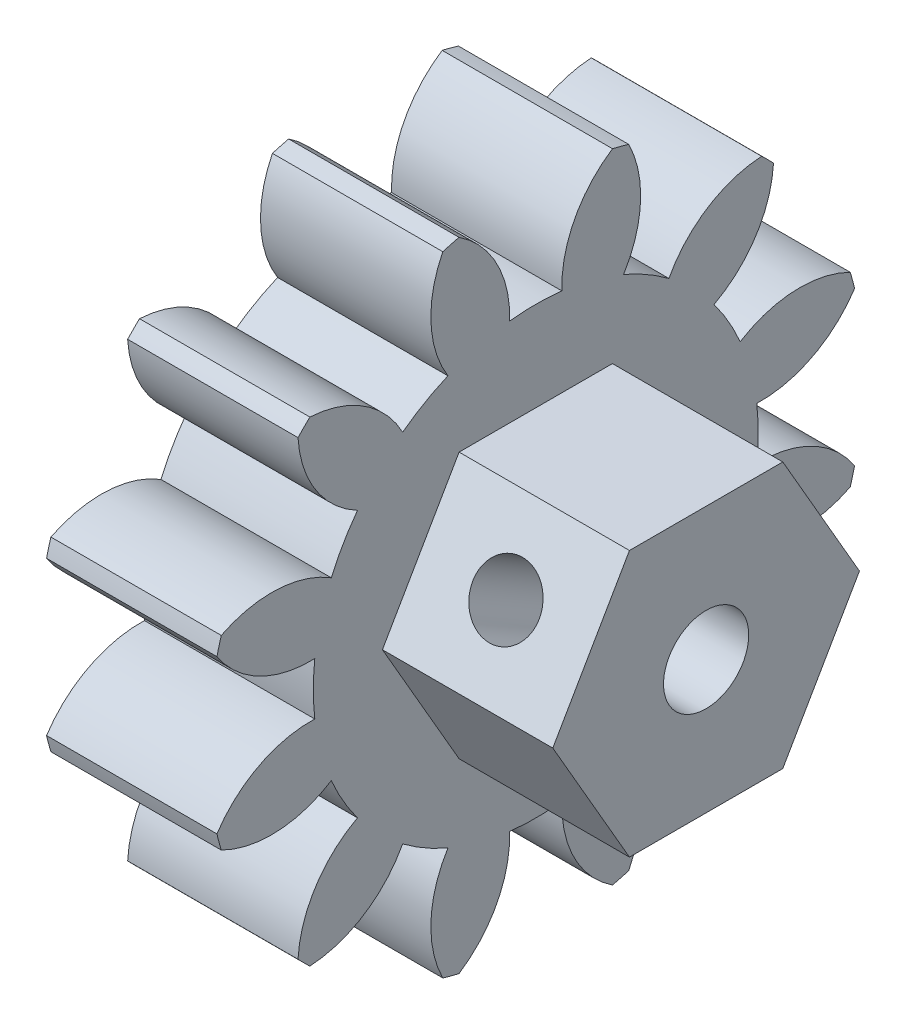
ISO-10303-21;
HEADER;
FILE_DESCRIPTION(('STEP AP214'),'2;1');
FILE_NAME('part.step','',(''),(''),'','','');
FILE_SCHEMA(('AUTOMOTIVE_DESIGN { 1 0 10303 214 1 1 1 1 }'));
ENDSEC;
DATA;
#1=APPLICATION_CONTEXT('core data for automotive mechanical design processes');
#2=APPLICATION_PROTOCOL_DEFINITION('international standard','automotive_design',2000,#1);
#3=PRODUCT_CONTEXT('',#1,'mechanical');
#4=PRODUCT('Part','Part','',(#3));
#5=PRODUCT_RELATED_PRODUCT_CATEGORY('part','',(#4));
#6=PRODUCT_DEFINITION_FORMATION('','',#4);
#7=PRODUCT_DEFINITION_CONTEXT('part definition',#1,'design');
#8=PRODUCT_DEFINITION('design','',#6,#7);
#9=PRODUCT_DEFINITION_SHAPE('','',#8);
#10=(LENGTH_UNIT() NAMED_UNIT(*) SI_UNIT(.MILLI.,.METRE.));
#11=(NAMED_UNIT(*) PLANE_ANGLE_UNIT() SI_UNIT($,.RADIAN.));
#12=(NAMED_UNIT(*) SI_UNIT($,.STERADIAN.) SOLID_ANGLE_UNIT());
#13=UNCERTAINTY_MEASURE_WITH_UNIT(LENGTH_MEASURE(1.E-05),#10,'distance_accuracy_value','');
#14=(GEOMETRIC_REPRESENTATION_CONTEXT(3) GLOBAL_UNCERTAINTY_ASSIGNED_CONTEXT((#13)) GLOBAL_UNIT_ASSIGNED_CONTEXT((#10,
#11,#12)) REPRESENTATION_CONTEXT('',''));
#15=CARTESIAN_POINT('',(0.,0.,0.));
#16=DIRECTION('',(0.,0.,1.));
#17=DIRECTION('',(1.,0.,0.));
#18=AXIS2_PLACEMENT_3D('',#15,#16,#17);
#19=CARTESIAN_POINT('',(3.13030619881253,-15.6363440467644,1.54071151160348));
#20=DIRECTION('',(-1.,0.,0.));
#21=DIRECTION('',(0.,0.,1.));
#22=AXIS2_PLACEMENT_3D('',#19,#20,#21);
#23=PLANE('',#22);
#24=CARTESIAN_POINT('',(3.13030619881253,-1.99342362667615,8.90776806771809));
#25=DIRECTION('',(-1.,0.,0.));
#26=DIRECTION('',(0.,0.86602540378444,-0.499999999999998));
#27=AXIS2_PLACEMENT_3D('',#24,#25,#26);
#28=CIRCLE('',#27,6.6000000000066);
#29=CARTESIAN_POINT('',(3.13030619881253,-7.82100252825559,12.0060456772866));
#30=VERTEX_POINT('',#29);
#31=CARTESIAN_POINT('',(3.13030619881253,-2.37752846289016,15.4965815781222));
#32=VERTEX_POINT('',#31);
#33=EDGE_CURVE('E422',#30,#32,#28,.T.);
#34=ORIENTED_EDGE('',*,*,#33,.F.);
#35=CARTESIAN_POINT('',(3.13030619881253,-15.6363440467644,1.54071151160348));
#36=DIRECTION('',(-1.,0.,0.));
#37=DIRECTION('',(0.,0.86602540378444,-0.499999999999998));
#38=AXIS2_PLACEMENT_3D('',#35,#36,#37);
#39=CIRCLE('',#38,13.0615000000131);
#40=CARTESIAN_POINT('',(3.13030619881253,-10.4807695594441,13.5416628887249));
#41=VERTEX_POINT('',#40);
#42=EDGE_CURVE('E429',#41,#30,#39,.T.);
#43=ORIENTED_EDGE('',*,*,#42,.F.);
#44=CARTESIAN_POINT('',(3.13030619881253,-16.0777461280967,17.0393554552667));
#45=DIRECTION('',(-1.,0.,0.));
#46=DIRECTION('',(0.,0.86602540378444,-0.499999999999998));
#47=AXIS2_PLACEMENT_3D('',#44,#45,#46);
#48=CIRCLE('',#47,6.6000000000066);
#49=CARTESIAN_POINT('',(3.13030619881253,-10.1796138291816,20.001117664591));
#50=VERTEX_POINT('',#49);
#51=EDGE_CURVE('E425',#50,#41,#48,.T.);
#52=ORIENTED_EDGE('',*,*,#51,.F.);
#53=CARTESIAN_POINT('',(3.13030619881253,-15.6363440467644,1.54071151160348));
#54=DIRECTION('',(-1.,0.,0.));
#55=DIRECTION('',(0.,0.,1.));
#56=AXIS2_PLACEMENT_3D('',#53,#54,#55);
#57=CIRCLE('',#56,19.2500000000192);
#58=CARTESIAN_POINT('',(3.13030619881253,-11.1318079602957,20.2562573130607));
#59=VERTEX_POINT('',#58);
#60=EDGE_CURVE('E937',#59,#50,#57,.T.);
#61=ORIENTED_EDGE('',*,*,#60,.F.);
#62=CARTESIAN_POINT('',(3.13030619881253,-7.50475665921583,14.7422298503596));
#63=DIRECTION('',(-1.,0.,0.));
#64=DIRECTION('',(0.,1.,0.));
#65=AXIS2_PLACEMENT_3D('',#62,#63,#64);
#66=CIRCLE('',#65,6.6000000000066);
#67=CARTESIAN_POINT('',(3.13030619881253,-14.1007268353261,14.5116275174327));
#68=VERTEX_POINT('',#67);
#69=EDGE_CURVE('E448',#68,#59,#66,.T.);
#70=ORIENTED_EDGE('',*,*,#69,.F.);
#71=CARTESIAN_POINT('',(3.13030619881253,-15.6363440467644,1.54071151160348));
#72=DIRECTION('',(-1.,0.,0.));
#73=DIRECTION('',(0.,1.,0.));
#74=AXIS2_PLACEMENT_3D('',#71,#72,#73);
#75=CIRCLE('',#74,13.0615000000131);
#76=CARTESIAN_POINT('',(3.13030619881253,-17.1719612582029,14.5116275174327));
#77=VERTEX_POINT('',#76);
#78=EDGE_CURVE('E455',#77,#68,#75,.T.);
#79=ORIENTED_EDGE('',*,*,#78,.F.);
#80=CARTESIAN_POINT('',(3.13030619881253,-23.7679314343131,14.7422298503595));
#81=DIRECTION('',(-1.,0.,0.));
#82=DIRECTION('',(0.,1.,0.));
#83=AXIS2_PLACEMENT_3D('',#80,#81,#82);
#84=CIRCLE('',#83,6.6000000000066);
#85=CARTESIAN_POINT('',(3.13030619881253,-20.1408801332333,20.2562573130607));
#86=VERTEX_POINT('',#85);
#87=EDGE_CURVE('E451',#86,#77,#84,.T.);
#88=ORIENTED_EDGE('',*,*,#87,.F.);
#89=CARTESIAN_POINT('',(3.13030619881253,-21.0930742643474,20.001117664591));
#90=VERTEX_POINT('',#89);
#91=EDGE_CURVE('E846',#90,#86,#57,.T.);
#92=ORIENTED_EDGE('',*,*,#91,.F.);
#93=CARTESIAN_POINT('',(3.13030619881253,-15.1949419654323,17.0393554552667));
#94=DIRECTION('',(-1.,0.,0.));
#95=DIRECTION('',(0.,0.866025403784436,0.500000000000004));
#96=AXIS2_PLACEMENT_3D('',#93,#94,#95);
#97=CIRCLE('',#96,6.6000000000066);
#98=CARTESIAN_POINT('',(3.13030619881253,-20.7919185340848,13.5416628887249));
#99=VERTEX_POINT('',#98);
#100=EDGE_CURVE('E522',#99,#90,#97,.T.);
#101=ORIENTED_EDGE('',*,*,#100,.F.);
#102=CARTESIAN_POINT('',(3.13030619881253,-15.6363440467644,1.54071151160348));
#103=DIRECTION('',(-1.,0.,0.));
#104=DIRECTION('',(0.,0.866025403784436,0.500000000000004));
#105=AXIS2_PLACEMENT_3D('',#102,#103,#104);
#106=CIRCLE('',#105,13.0615000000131);
#107=CARTESIAN_POINT('',(3.13030619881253,-23.4516855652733,12.0060456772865));
#108=VERTEX_POINT('',#107);
#109=EDGE_CURVE('E529',#108,#99,#106,.T.);
#110=ORIENTED_EDGE('',*,*,#109,.F.);
#111=CARTESIAN_POINT('',(3.13030619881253,-29.2792644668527,8.907768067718));
#112=DIRECTION('',(-1.,0.,0.));
#113=DIRECTION('',(0.,0.866025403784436,0.500000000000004));
#114=AXIS2_PLACEMENT_3D('',#111,#112,#113);
#115=CIRCLE('',#114,6.6000000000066);
#116=CARTESIAN_POINT('',(3.13030619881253,-28.8951596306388,15.4965815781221));
#117=VERTEX_POINT('',#116);
#118=EDGE_CURVE('E525',#117,#108,#115,.T.);
#119=ORIENTED_EDGE('',*,*,#118,.F.);
#120=CARTESIAN_POINT('',(3.13030619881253,-29.5922141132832,14.7995270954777));
#121=VERTEX_POINT('',#120);
#122=EDGE_CURVE('E922',#121,#117,#57,.T.);
#123=ORIENTED_EDGE('',*,*,#122,.F.);
#124=CARTESIAN_POINT('',(3.13030619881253,-23.0034006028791,15.1836319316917));
#125=DIRECTION('',(-1.,0.,0.));
#126=DIRECTION('',(0.,0.499999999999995,0.866025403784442));
#127=AXIS2_PLACEMENT_3D('',#124,#125,#126);
#128=CIRCLE('',#127,6.6000000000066);
#129=CARTESIAN_POINT('',(3.13030619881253,-26.1016782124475,9.35605303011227));
#130=VERTEX_POINT('',#129);
#131=EDGE_CURVE('E472',#130,#121,#128,.T.);
#132=ORIENTED_EDGE('',*,*,#131,.F.);
#133=CARTESIAN_POINT('',(3.13030619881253,-15.6363440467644,1.54071151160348));
#134=DIRECTION('',(-1.,0.,0.));
#135=DIRECTION('',(0.,0.499999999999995,0.866025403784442));
#136=AXIS2_PLACEMENT_3D('',#133,#134,#135);
#137=CIRCLE('',#136,13.0615000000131);
#138=CARTESIAN_POINT('',(3.13030619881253,-27.6372954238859,6.69628599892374));
#139=VERTEX_POINT('',#138);
#140=EDGE_CURVE('E479',#139,#130,#137,.T.);
#141=ORIENTED_EDGE('',*,*,#140,.F.);
#142=CARTESIAN_POINT('',(3.13030619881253,-31.1349879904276,1.09930943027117));
#143=DIRECTION('',(-1.,0.,0.));
#144=DIRECTION('',(0.,0.499999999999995,0.866025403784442));
#145=AXIS2_PLACEMENT_3D('',#142,#143,#144);
#146=CIRCLE('',#145,6.6000000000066);
#147=CARTESIAN_POINT('',(3.13030619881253,-34.096750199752,6.99744172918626));
#148=VERTEX_POINT('',#147);
#149=EDGE_CURVE('E475',#148,#139,#146,.T.);
#150=ORIENTED_EDGE('',*,*,#149,.F.);
#151=CARTESIAN_POINT('',(3.13030619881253,-34.3518898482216,6.04524759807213));
#152=VERTEX_POINT('',#151);
#153=EDGE_CURVE('E898',#152,#148,#57,.T.);
#154=ORIENTED_EDGE('',*,*,#153,.F.);
#155=CARTESIAN_POINT('',(3.13030619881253,-28.8378623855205,9.67229889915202));
#156=DIRECTION('',(-1.,0.,0.));
#157=DIRECTION('',(0.,0.,1.));
#158=AXIS2_PLACEMENT_3D('',#155,#156,#157);
#159=CIRCLE('',#158,6.6000000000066);
#160=CARTESIAN_POINT('',(3.13030619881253,-28.6072600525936,3.07632872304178));
#161=VERTEX_POINT('',#160);
#162=EDGE_CURVE('E498',#161,#152,#159,.T.);
#163=ORIENTED_EDGE('',*,*,#162,.F.);
#164=CARTESIAN_POINT('',(3.13030619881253,-15.6363440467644,1.54071151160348));
#165=DIRECTION('',(-1.,0.,0.));
#166=DIRECTION('',(0.,0.,1.));
#167=AXIS2_PLACEMENT_3D('',#164,#165,#166);
#168=CIRCLE('',#167,13.0615000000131);
#169=CARTESIAN_POINT('',(3.13030619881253,-28.6072600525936,0.00509430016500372));
#170=VERTEX_POINT('',#169);
#171=EDGE_CURVE('E505',#170,#161,#168,.T.);
#172=ORIENTED_EDGE('',*,*,#171,.F.);
#173=CARTESIAN_POINT('',(3.13030619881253,-28.8378623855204,-6.59087587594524));
#174=DIRECTION('',(-1.,0.,0.));
#175=DIRECTION('',(0.,0.,1.));
#176=AXIS2_PLACEMENT_3D('',#173,#174,#175);
#177=CIRCLE('',#176,6.6000000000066);
#178=CARTESIAN_POINT('',(3.13030619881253,-34.3518898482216,-2.96382457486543));
#179=VERTEX_POINT('',#178);
#180=EDGE_CURVE('E501',#179,#170,#177,.T.);
#181=ORIENTED_EDGE('',*,*,#180,.F.);
#182=CARTESIAN_POINT('',(3.13030619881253,-34.0967501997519,-3.91601870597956));
#183=VERTEX_POINT('',#182);
#184=EDGE_CURVE('E978',#183,#179,#57,.T.);
#185=ORIENTED_EDGE('',*,*,#184,.F.);
#186=CARTESIAN_POINT('',(3.13030619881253,-31.1349879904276,1.98211359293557));
#187=DIRECTION('',(-1.,0.,0.));
#188=DIRECTION('',(0.,-0.500000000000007,0.866025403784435));
#189=AXIS2_PLACEMENT_3D('',#186,#187,#188);
#190=CIRCLE('',#189,6.6000000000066);
#191=CARTESIAN_POINT('',(3.13030619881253,-27.6372954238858,-3.61486297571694));
#192=VERTEX_POINT('',#191);
#193=EDGE_CURVE('E570',#192,#183,#190,.T.);
#194=ORIENTED_EDGE('',*,*,#193,.F.);
#195=CARTESIAN_POINT('',(3.13030619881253,-15.6363440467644,1.54071151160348));
#196=DIRECTION('',(-1.,0.,0.));
#197=DIRECTION('',(0.,-0.500000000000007,0.866025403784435));
#198=AXIS2_PLACEMENT_3D('',#195,#196,#197);
#199=CIRCLE('',#198,13.0615000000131);
#200=CARTESIAN_POINT('',(3.13030619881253,-26.1016782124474,-6.27463000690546));
#201=VERTEX_POINT('',#200);
#202=EDGE_CURVE('E577',#201,#192,#199,.T.);
#203=ORIENTED_EDGE('',*,*,#202,.F.);
#204=CARTESIAN_POINT('',(3.13030619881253,-23.0034006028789,-12.1022089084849));
#205=DIRECTION('',(-1.,0.,0.));
#206=DIRECTION('',(0.,-0.500000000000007,0.866025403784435));
#207=AXIS2_PLACEMENT_3D('',#204,#205,#206);
#208=CIRCLE('',#207,6.6000000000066);
#209=CARTESIAN_POINT('',(3.13030619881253,-29.592214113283,-11.7181040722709));
#210=VERTEX_POINT('',#209);
#211=EDGE_CURVE('E573',#210,#201,#208,.T.);
#212=ORIENTED_EDGE('',*,*,#211,.F.);
#213=CARTESIAN_POINT('',(3.13030619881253,-28.8951596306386,-12.4151585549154));
#214=VERTEX_POINT('',#213);
#215=EDGE_CURVE('E971',#214,#210,#57,.T.);
#216=ORIENTED_EDGE('',*,*,#215,.F.);
#217=CARTESIAN_POINT('',(3.13030619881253,-29.2792644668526,-5.82634504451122));
#218=DIRECTION('',(-1.,0.,0.));
#219=DIRECTION('',(0.,-0.866025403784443,0.499999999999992));
#220=AXIS2_PLACEMENT_3D('',#217,#218,#219);
#221=CIRCLE('',#220,6.6000000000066);
#222=CARTESIAN_POINT('',(3.13030619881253,-23.4516855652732,-8.92462265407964));
#223=VERTEX_POINT('',#222);
#224=EDGE_CURVE('E544',#223,#214,#221,.T.);
#225=ORIENTED_EDGE('',*,*,#224,.F.);
#226=CARTESIAN_POINT('',(3.13030619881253,-15.6363440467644,1.54071151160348));
#227=DIRECTION('',(-1.,0.,0.));
#228=DIRECTION('',(0.,-0.866025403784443,0.499999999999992));
#229=AXIS2_PLACEMENT_3D('',#226,#227,#228);
#230=CIRCLE('',#229,13.0615000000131);
#231=CARTESIAN_POINT('',(3.13030619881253,-20.7919185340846,-10.460239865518));
#232=VERTEX_POINT('',#231);
#233=EDGE_CURVE('E551',#232,#223,#230,.T.);
#234=ORIENTED_EDGE('',*,*,#233,.F.);
#235=CARTESIAN_POINT('',(3.13030619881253,-15.1949419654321,-13.9579324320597));
#236=DIRECTION('',(-1.,0.,0.));
#237=DIRECTION('',(0.,-0.866025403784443,0.499999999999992));
#238=AXIS2_PLACEMENT_3D('',#235,#236,#237);
#239=CIRCLE('',#238,6.6000000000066);
#240=CARTESIAN_POINT('',(3.13030619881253,-21.0930742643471,-16.9196946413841));
#241=VERTEX_POINT('',#240);
#242=EDGE_CURVE('E547',#241,#232,#239,.T.);
#243=ORIENTED_EDGE('',*,*,#242,.F.);
#244=CARTESIAN_POINT('',(3.13030619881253,-20.140880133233,-17.1748342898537));
#245=VERTEX_POINT('',#244);
#246=EDGE_CURVE('E964',#245,#241,#57,.T.);
#247=ORIENTED_EDGE('',*,*,#246,.F.);
#248=CARTESIAN_POINT('',(3.13030619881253,-23.7679314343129,-11.6608068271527));
#249=DIRECTION('',(-1.,0.,0.));
#250=DIRECTION('',(0.,-1.,0.));
#251=AXIS2_PLACEMENT_3D('',#248,#249,#250);
#252=CIRCLE('',#251,6.6000000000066);
#253=CARTESIAN_POINT('',(3.13030619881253,-17.1719612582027,-11.4302044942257));
#254=VERTEX_POINT('',#253);
#255=EDGE_CURVE('E592',#254,#245,#252,.T.);
#256=ORIENTED_EDGE('',*,*,#255,.F.);
#257=CARTESIAN_POINT('',(3.13030619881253,-15.6363440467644,1.54071151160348));
#258=DIRECTION('',(-1.,0.,0.));
#259=DIRECTION('',(0.,-1.,0.));
#260=AXIS2_PLACEMENT_3D('',#257,#258,#259);
#261=CIRCLE('',#260,13.0615000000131);
#262=CARTESIAN_POINT('',(3.13030619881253,-14.1007268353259,-11.4302044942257));
#263=VERTEX_POINT('',#262);
#264=EDGE_CURVE('E599',#263,#254,#261,.T.);
#265=ORIENTED_EDGE('',*,*,#264,.F.);
#266=CARTESIAN_POINT('',(3.13030619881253,-7.50475665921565,-11.6608068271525));
#267=DIRECTION('',(-1.,0.,0.));
#268=DIRECTION('',(0.,-1.,0.));
#269=AXIS2_PLACEMENT_3D('',#266,#267,#268);
#270=CIRCLE('',#269,6.6000000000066);
#271=CARTESIAN_POINT('',(3.13030619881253,-11.1318079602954,-17.1748342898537));
#272=VERTEX_POINT('',#271);
#273=EDGE_CURVE('E595',#272,#263,#270,.T.);
#274=ORIENTED_EDGE('',*,*,#273,.F.);
#275=CARTESIAN_POINT('',(3.13030619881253,-10.1796138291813,-16.919694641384));
#276=VERTEX_POINT('',#275);
#277=EDGE_CURVE('E957',#276,#272,#57,.T.);
#278=ORIENTED_EDGE('',*,*,#277,.F.);
#279=CARTESIAN_POINT('',(3.13030619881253,-16.0777461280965,-13.9579324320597));
#280=DIRECTION('',(-1.,0.,0.));
#281=DIRECTION('',(0.,-0.866025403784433,-0.50000000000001));
#282=AXIS2_PLACEMENT_3D('',#279,#280,#281);
#283=CIRCLE('',#282,6.6000000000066);
#284=CARTESIAN_POINT('',(3.13030619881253,-10.480769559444,-10.4602398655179));
#285=VERTEX_POINT('',#284);
#286=EDGE_CURVE('E640',#285,#276,#283,.T.);
#287=ORIENTED_EDGE('',*,*,#286,.F.);
#288=CARTESIAN_POINT('',(3.13030619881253,-15.6363440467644,1.54071151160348));
#289=DIRECTION('',(-1.,0.,0.));
#290=DIRECTION('',(0.,-0.866025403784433,-0.50000000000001));
#291=AXIS2_PLACEMENT_3D('',#288,#289,#290);
#292=CIRCLE('',#291,13.0615000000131);
#293=CARTESIAN_POINT('',(3.13030619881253,-7.82100252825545,-8.92462265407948));
#294=VERTEX_POINT('',#293);
#295=EDGE_CURVE('E647',#294,#285,#292,.T.);
#296=ORIENTED_EDGE('',*,*,#295,.F.);
#297=CARTESIAN_POINT('',(3.13030619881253,-1.99342362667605,-5.82634504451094));
#298=DIRECTION('',(-1.,0.,0.));
#299=DIRECTION('',(0.,-0.866025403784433,-0.50000000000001));
#300=AXIS2_PLACEMENT_3D('',#297,#298,#299);
#301=CIRCLE('',#300,6.6000000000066);
#302=CARTESIAN_POINT('',(3.13030619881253,-2.37752846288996,-12.4151585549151));
#303=VERTEX_POINT('',#302);
#304=EDGE_CURVE('E643',#303,#294,#301,.T.);
#305=ORIENTED_EDGE('',*,*,#304,.F.);
#306=CARTESIAN_POINT('',(3.13030619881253,-1.68047398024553,-11.7181040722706));
#307=VERTEX_POINT('',#306);
#308=EDGE_CURVE('E796',#307,#303,#57,.T.);
#309=ORIENTED_EDGE('',*,*,#308,.F.);
#310=CARTESIAN_POINT('',(3.13030619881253,-8.26928749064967,-12.1022089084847));
#311=DIRECTION('',(-1.,0.,0.));
#312=DIRECTION('',(0.,-0.499999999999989,-0.866025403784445));
#313=AXIS2_PLACEMENT_3D('',#310,#311,#312);
#314=CIRCLE('',#313,6.6000000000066);
#315=CARTESIAN_POINT('',(3.13030619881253,-5.17100988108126,-6.27463000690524));
#316=VERTEX_POINT('',#315);
#317=EDGE_CURVE('E616',#316,#307,#314,.T.);
#318=ORIENTED_EDGE('',*,*,#317,.F.);
#319=CARTESIAN_POINT('',(3.13030619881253,-15.6363440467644,1.54071151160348));
#320=DIRECTION('',(-1.,0.,0.));
#321=DIRECTION('',(0.,-0.499999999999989,-0.866025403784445));
#322=AXIS2_PLACEMENT_3D('',#319,#320,#321);
#323=CIRCLE('',#322,13.0615000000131);
#324=CARTESIAN_POINT('',(3.13030619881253,-3.63539266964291,-3.61486297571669));
#325=VERTEX_POINT('',#324);
#326=EDGE_CURVE('E623',#325,#316,#323,.T.);
#327=ORIENTED_EDGE('',*,*,#326,.F.);
#328=CARTESIAN_POINT('',(3.13030619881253,-0.137700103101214,1.9821135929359));
#329=DIRECTION('',(-1.,0.,0.));
#330=DIRECTION('',(0.,-0.499999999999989,-0.866025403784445));
#331=AXIS2_PLACEMENT_3D('',#328,#329,#330);
#332=CIRCLE('',#331,6.6000000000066);
#333=CARTESIAN_POINT('',(3.13030619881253,2.82406210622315,-3.91601870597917));
#334=VERTEX_POINT('',#333);
#335=EDGE_CURVE('E619',#334,#325,#332,.T.);
#336=ORIENTED_EDGE('',*,*,#335,.F.);
#337=CARTESIAN_POINT('',(3.13030619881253,3.07920175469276,-2.9638245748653));
#338=VERTEX_POINT('',#337);
#339=EDGE_CURVE('E791',#338,#334,#57,.T.);
#340=ORIENTED_EDGE('',*,*,#339,.F.);
#341=CARTESIAN_POINT('',(3.13030619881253,-2.43482570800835,-6.59087587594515));
#342=DIRECTION('',(-1.,0.,0.));
#343=DIRECTION('',(0.,0.,-1.));
#344=AXIS2_PLACEMENT_3D('',#341,#342,#343);
#345=CIRCLE('',#344,6.6000000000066);
#346=CARTESIAN_POINT('',(3.13030619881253,-2.66542804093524,0.00509430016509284));
#347=VERTEX_POINT('',#346);
#348=EDGE_CURVE('E753',#347,#338,#345,.T.);
#349=ORIENTED_EDGE('',*,*,#348,.F.);
#350=CARTESIAN_POINT('',(3.13030619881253,-15.6363440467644,1.54071151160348));
#351=DIRECTION('',(-1.,0.,0.));
#352=DIRECTION('',(0.,0.,-1.));
#353=AXIS2_PLACEMENT_3D('',#350,#351,#352);
#354=CIRCLE('',#353,13.0615000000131);
#355=CARTESIAN_POINT('',(3.13030619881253,-2.66542804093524,3.07632872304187));
#356=VERTEX_POINT('',#355);
#357=EDGE_CURVE('E760',#356,#347,#354,.T.);
#358=ORIENTED_EDGE('',*,*,#357,.F.);
#359=CARTESIAN_POINT('',(3.13030619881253,-2.43482570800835,9.67229889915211));
#360=DIRECTION('',(-1.,0.,0.));
#361=DIRECTION('',(0.,0.,-1.));
#362=AXIS2_PLACEMENT_3D('',#359,#360,#361);
#363=CIRCLE('',#362,6.6000000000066);
#364=CARTESIAN_POINT('',(3.13030619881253,3.07920175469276,6.04524759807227));
#365=VERTEX_POINT('',#364);
#366=EDGE_CURVE('E756',#365,#356,#363,.T.);
#367=ORIENTED_EDGE('',*,*,#366,.F.);
#368=CARTESIAN_POINT('',(3.13030619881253,2.82406210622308,6.99744172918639));
#369=VERTEX_POINT('',#368);
#370=EDGE_CURVE('E788',#369,#365,#57,.T.);
#371=ORIENTED_EDGE('',*,*,#370,.F.);
#372=CARTESIAN_POINT('',(3.13030619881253,-0.137700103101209,1.09930943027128));
#373=DIRECTION('',(-1.,0.,0.));
#374=DIRECTION('',(0.,0.500000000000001,-0.866025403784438));
#375=AXIS2_PLACEMENT_3D('',#372,#373,#374);
#376=CIRCLE('',#375,6.6000000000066);
#377=CARTESIAN_POINT('',(3.13030619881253,-3.63539266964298,6.69628599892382));
#378=VERTEX_POINT('',#377);
#379=EDGE_CURVE('E722',#378,#369,#376,.T.);
#380=ORIENTED_EDGE('',*,*,#379,.F.);
#381=CARTESIAN_POINT('',(3.13030619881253,-15.6363440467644,1.54071151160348));
#382=DIRECTION('',(-1.,0.,0.));
#383=DIRECTION('',(0.,0.500000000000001,-0.866025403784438));
#384=AXIS2_PLACEMENT_3D('',#381,#382,#383);
#385=CIRCLE('',#384,13.0615000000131);
#386=CARTESIAN_POINT('',(3.13030619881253,-5.17100988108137,9.35605303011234));
#387=VERTEX_POINT('',#386);
#388=EDGE_CURVE('E729',#387,#378,#385,.T.);
#389=ORIENTED_EDGE('',*,*,#388,.F.);
#390=CARTESIAN_POINT('',(3.13030619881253,-8.26928749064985,15.1836319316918));
#391=DIRECTION('',(-1.,0.,0.));
#392=DIRECTION('',(0.,0.500000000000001,-0.866025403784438));
#393=AXIS2_PLACEMENT_3D('',#390,#391,#392);
#394=CIRCLE('',#393,6.6000000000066);
#395=CARTESIAN_POINT('',(3.13030619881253,-1.68047398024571,14.7995270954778));
#396=VERTEX_POINT('',#395);
#397=EDGE_CURVE('E725',#396,#387,#394,.T.);
#398=ORIENTED_EDGE('',*,*,#397,.F.);
#399=EDGE_CURVE('E797',#32,#396,#57,.T.);
#400=ORIENTED_EDGE('',*,*,#399,.F.);
#401=EDGE_LOOP('',(#34,#43,#52,#61,#70,#79,#88,#92,#101,#110,#119,#123,#132,#141,#150,#154,#163,
#172,#181,#185,#194,#203,#212,#216,#225,#234,#243,#247,#256,#265,#274,#278,#287,#296,#305,#309,
#318,#327,#336,#340,#349,#358,#367,#371,#380,#389,#398,#400));
#402=FACE_BOUND('',#401,.T.);
#403=DIRECTION('',(0.,-0.866025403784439,0.5));
#404=VECTOR('',#403,1.);
#405=CARTESIAN_POINT('',(3.13030619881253,-7.84211541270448,6.04071151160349));
#406=LINE('',#405,#404);
#407=CARTESIAN_POINT('',(3.13030619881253,-7.84211541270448,6.04071151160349));
#408=VERTEX_POINT('',#407);
#409=CARTESIAN_POINT('',(3.13030619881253,-15.6363440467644,10.5407115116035));
#410=VERTEX_POINT('',#409);
#411=EDGE_CURVE('E411',#408,#410,#406,.T.);
#412=ORIENTED_EDGE('',*,*,#411,.F.);
#413=DIRECTION('',(0.,0.,1.));
#414=VECTOR('',#413,1.);
#415=CARTESIAN_POINT('',(3.13030619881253,-7.84211541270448,-2.95928848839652));
#416=LINE('',#415,#414);
#417=CARTESIAN_POINT('',(3.13030619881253,-7.84211541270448,-2.95928848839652));
#418=VERTEX_POINT('',#417);
#419=EDGE_CURVE('E408',#418,#408,#416,.T.);
#420=ORIENTED_EDGE('',*,*,#419,.F.);
#421=DIRECTION('',(0.,0.866025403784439,0.5));
#422=VECTOR('',#421,1.);
#423=CARTESIAN_POINT('',(3.13030619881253,-15.6363440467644,-7.45928848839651));
#424=LINE('',#423,#422);
#425=CARTESIAN_POINT('',(3.13030619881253,-15.6363440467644,-7.45928848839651));
#426=VERTEX_POINT('',#425);
#427=EDGE_CURVE('E1378',#426,#418,#424,.T.);
#428=ORIENTED_EDGE('',*,*,#427,.F.);
#429=DIRECTION('',(0.,0.866025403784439,-0.5));
#430=VECTOR('',#429,1.);
#431=CARTESIAN_POINT('',(3.13030619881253,-23.4305726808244,-2.95928848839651));
#432=LINE('',#431,#430);
#433=CARTESIAN_POINT('',(3.13030619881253,-23.4305726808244,-2.95928848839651));
#434=VERTEX_POINT('',#433);
#435=EDGE_CURVE('E1374',#434,#426,#432,.T.);
#436=ORIENTED_EDGE('',*,*,#435,.F.);
#437=DIRECTION('',(0.,0.,-1.));
#438=VECTOR('',#437,1.);
#439=CARTESIAN_POINT('',(3.13030619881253,-23.4305726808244,6.04071151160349));
#440=LINE('',#439,#438);
#441=CARTESIAN_POINT('',(3.13030619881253,-23.4305726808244,6.04071151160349));
#442=VERTEX_POINT('',#441);
#443=EDGE_CURVE('E68',#442,#434,#440,.T.);
#444=ORIENTED_EDGE('',*,*,#443,.F.);
#445=DIRECTION('',(0.,-0.866025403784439,-0.5));
#446=VECTOR('',#445,1.);
#447=CARTESIAN_POINT('',(3.13030619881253,-15.6363440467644,10.5407115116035));
#448=LINE('',#447,#446);
#449=EDGE_CURVE('E63',#410,#442,#448,.T.);
#450=ORIENTED_EDGE('',*,*,#449,.F.);
#451=EDGE_LOOP('',(#412,#420,#428,#436,#444,#450));
#452=FACE_BOUND('',#451,.T.);
#453=ADVANCED_FACE('F47',(#402,#452),#23,.F.);
#454=CARTESIAN_POINT('',(-16.8696938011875,-15.6363440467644,1.54071151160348));
#455=DIRECTION('',(-1.,0.,0.));
#456=DIRECTION('',(0.,0.,1.));
#457=AXIS2_PLACEMENT_3D('',#454,#455,#456);
#458=CYLINDRICAL_SURFACE('',#457,19.2500000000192);
#459=DIRECTION('',(-1.,0.,0.));
#460=VECTOR('',#459,1.);
#461=CARTESIAN_POINT('',(-1.86969380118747,-2.37752846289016,15.4965815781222));
#462=LINE('',#461,#460);
#463=CARTESIAN_POINT('',(-6.86969380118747,-2.37752846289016,15.4965815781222));
#464=VERTEX_POINT('',#463);
#465=EDGE_CURVE('E718',#32,#464,#462,.T.);
#466=ORIENTED_EDGE('',*,*,#465,.F.);
#467=ORIENTED_EDGE('',*,*,#399,.T.);
#468=DIRECTION('',(-1.,0.,0.));
#469=VECTOR('',#468,1.);
#470=CARTESIAN_POINT('',(-1.86969380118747,-1.68047398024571,14.7995270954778));
#471=LINE('',#470,#469);
#472=CARTESIAN_POINT('',(-6.86969380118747,-1.68047398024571,14.7995270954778));
#473=VERTEX_POINT('',#472);
#474=EDGE_CURVE('E745',#473,#396,#471,.F.);
#475=ORIENTED_EDGE('',*,*,#474,.F.);
#476=CARTESIAN_POINT('',(-6.86969380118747,-15.6363440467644,1.54071151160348));
#477=DIRECTION('',(-1.,0.,0.));
#478=DIRECTION('',(0.,0.,1.));
#479=AXIS2_PLACEMENT_3D('',#476,#477,#478);
#480=CIRCLE('',#479,19.2500000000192);
#481=EDGE_CURVE('E790',#464,#473,#480,.T.);
#482=ORIENTED_EDGE('',*,*,#481,.F.);
#483=EDGE_LOOP('',(#466,#467,#475,#482));
#484=FACE_BOUND('',#483,.T.);
#485=ADVANCED_FACE('F1014',(#484),#458,.T.);
#486=DIRECTION('',(-1.,0.,0.));
#487=VECTOR('',#486,1.);
#488=CARTESIAN_POINT('',(-1.86969380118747,-10.1796138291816,20.001117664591));
#489=LINE('',#488,#487);
#490=CARTESIAN_POINT('',(-6.86969380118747,-10.1796138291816,20.001117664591));
#491=VERTEX_POINT('',#490);
#492=EDGE_CURVE('E715',#491,#50,#489,.F.);
#493=ORIENTED_EDGE('',*,*,#492,.F.);
#494=CARTESIAN_POINT('',(-6.86969380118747,-11.1318079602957,20.2562573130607));
#495=VERTEX_POINT('',#494);
#496=EDGE_CURVE('E850',#495,#491,#480,.T.);
#497=ORIENTED_EDGE('',*,*,#496,.F.);
#498=DIRECTION('',(-1.,0.,0.));
#499=VECTOR('',#498,1.);
#500=CARTESIAN_POINT('',(-1.86969380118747,-11.1318079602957,20.2562573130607));
#501=LINE('',#500,#499);
#502=EDGE_CURVE('E712',#59,#495,#501,.T.);
#503=ORIENTED_EDGE('',*,*,#502,.F.);
#504=ORIENTED_EDGE('',*,*,#60,.T.);
#505=EDGE_LOOP('',(#493,#497,#503,#504));
#506=FACE_BOUND('',#505,.T.);
#507=ADVANCED_FACE('F1020',(#506),#458,.T.);
#508=DIRECTION('',(-1.,0.,0.));
#509=VECTOR('',#508,1.);
#510=CARTESIAN_POINT('',(-1.86969380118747,-20.1408801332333,20.2562573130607));
#511=LINE('',#510,#509);
#512=CARTESIAN_POINT('',(-6.86969380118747,-20.1408801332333,20.2562573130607));
#513=VERTEX_POINT('',#512);
#514=EDGE_CURVE('E709',#513,#86,#511,.F.);
#515=ORIENTED_EDGE('',*,*,#514,.F.);
#516=CARTESIAN_POINT('',(-6.86969380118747,-21.0930742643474,20.001117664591));
#517=VERTEX_POINT('',#516);
#518=EDGE_CURVE('E844',#517,#513,#480,.T.);
#519=ORIENTED_EDGE('',*,*,#518,.F.);
#520=DIRECTION('',(-1.,0.,0.));
#521=VECTOR('',#520,1.);
#522=CARTESIAN_POINT('',(-1.86969380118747,-21.0930742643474,20.001117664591));
#523=LINE('',#522,#521);
#524=EDGE_CURVE('E694',#90,#517,#523,.T.);
#525=ORIENTED_EDGE('',*,*,#524,.F.);
#526=ORIENTED_EDGE('',*,*,#91,.T.);
#527=EDGE_LOOP('',(#515,#519,#525,#526));
#528=FACE_BOUND('',#527,.T.);
#529=ADVANCED_FACE('F842',(#528),#458,.T.);
#530=DIRECTION('',(-1.,0.,0.));
#531=VECTOR('',#530,1.);
#532=CARTESIAN_POINT('',(-1.86969380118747,-34.3518898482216,6.04524759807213));
#533=LINE('',#532,#531);
#534=CARTESIAN_POINT('',(-6.86969380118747,-34.3518898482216,6.04524759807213));
#535=VERTEX_POINT('',#534);
#536=EDGE_CURVE('E706',#152,#535,#533,.T.);
#537=ORIENTED_EDGE('',*,*,#536,.F.);
#538=ORIENTED_EDGE('',*,*,#153,.T.);
#539=DIRECTION('',(-1.,0.,0.));
#540=VECTOR('',#539,1.);
#541=CARTESIAN_POINT('',(-1.86969380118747,-34.096750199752,6.99744172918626));
#542=LINE('',#541,#540);
#543=CARTESIAN_POINT('',(-6.86969380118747,-34.096750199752,6.99744172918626));
#544=VERTEX_POINT('',#543);
#545=EDGE_CURVE('E697',#544,#148,#542,.F.);
#546=ORIENTED_EDGE('',*,*,#545,.F.);
#547=EDGE_CURVE('E854',#535,#544,#480,.T.);
#548=ORIENTED_EDGE('',*,*,#547,.F.);
#549=EDGE_LOOP('',(#537,#538,#546,#548));
#550=FACE_BOUND('',#549,.T.);
#551=ADVANCED_FACE('F895',(#550),#458,.T.);
#552=DIRECTION('',(-1.,0.,0.));
#553=VECTOR('',#552,1.);
#554=CARTESIAN_POINT('',(-1.86969380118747,-34.3518898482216,-2.96382457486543));
#555=LINE('',#554,#553);
#556=CARTESIAN_POINT('',(-6.86969380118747,-34.3518898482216,-2.96382457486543));
#557=VERTEX_POINT('',#556);
#558=EDGE_CURVE('E703',#557,#179,#555,.F.);
#559=ORIENTED_EDGE('',*,*,#558,.F.);
#560=CARTESIAN_POINT('',(-6.86969380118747,-34.0967501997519,-3.91601870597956));
#561=VERTEX_POINT('',#560);
#562=EDGE_CURVE('E881',#561,#557,#480,.T.);
#563=ORIENTED_EDGE('',*,*,#562,.F.);
#564=DIRECTION('',(-1.,0.,0.));
#565=VECTOR('',#564,1.);
#566=CARTESIAN_POINT('',(-1.86969380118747,-34.0967501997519,-3.91601870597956));
#567=LINE('',#566,#565);
#568=EDGE_CURVE('E682',#183,#561,#567,.T.);
#569=ORIENTED_EDGE('',*,*,#568,.F.);
#570=ORIENTED_EDGE('',*,*,#184,.T.);
#571=EDGE_LOOP('',(#559,#563,#569,#570));
#572=FACE_BOUND('',#571,.T.);
#573=ADVANCED_FACE('F990',(#572),#458,.T.);
#574=DIRECTION('',(-1.,0.,0.));
#575=VECTOR('',#574,1.);
#576=CARTESIAN_POINT('',(-1.86969380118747,-29.5922141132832,14.7995270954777));
#577=LINE('',#576,#575);
#578=CARTESIAN_POINT('',(-6.86969380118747,-29.5922141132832,14.7995270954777));
#579=VERTEX_POINT('',#578);
#580=EDGE_CURVE('E700',#121,#579,#577,.T.);
#581=ORIENTED_EDGE('',*,*,#580,.F.);
#582=ORIENTED_EDGE('',*,*,#122,.T.);
#583=DIRECTION('',(-1.,0.,0.));
#584=VECTOR('',#583,1.);
#585=CARTESIAN_POINT('',(-1.86969380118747,-28.8951596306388,15.4965815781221));
#586=LINE('',#585,#584);
#587=CARTESIAN_POINT('',(-6.86969380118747,-28.8951596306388,15.4965815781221));
#588=VERTEX_POINT('',#587);
#589=EDGE_CURVE('E691',#588,#117,#586,.F.);
#590=ORIENTED_EDGE('',*,*,#589,.F.);
#591=EDGE_CURVE('E849',#579,#588,#480,.T.);
#592=ORIENTED_EDGE('',*,*,#591,.F.);
#593=EDGE_LOOP('',(#581,#582,#590,#592));
#594=FACE_BOUND('',#593,.T.);
#595=ADVANCED_FACE('F920',(#594),#458,.T.);
#596=DIRECTION('',(-1.,0.,0.));
#597=VECTOR('',#596,1.);
#598=CARTESIAN_POINT('',(-1.86969380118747,-28.8951596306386,-12.4151585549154));
#599=LINE('',#598,#597);
#600=CARTESIAN_POINT('',(-6.86969380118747,-28.8951596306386,-12.4151585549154));
#601=VERTEX_POINT('',#600);
#602=EDGE_CURVE('E688',#214,#601,#599,.T.);
#603=ORIENTED_EDGE('',*,*,#602,.F.);
#604=ORIENTED_EDGE('',*,*,#215,.T.);
#605=DIRECTION('',(-1.,0.,0.));
#606=VECTOR('',#605,1.);
#607=CARTESIAN_POINT('',(-1.86969380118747,-29.592214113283,-11.7181040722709));
#608=LINE('',#607,#606);
#609=CARTESIAN_POINT('',(-6.86969380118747,-29.592214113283,-11.7181040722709));
#610=VERTEX_POINT('',#609);
#611=EDGE_CURVE('E679',#610,#210,#608,.F.);
#612=ORIENTED_EDGE('',*,*,#611,.F.);
#613=EDGE_CURVE('E876',#601,#610,#480,.T.);
#614=ORIENTED_EDGE('',*,*,#613,.F.);
#615=EDGE_LOOP('',(#603,#604,#612,#614));
#616=FACE_BOUND('',#615,.T.);
#617=ADVANCED_FACE('F1105',(#616),#458,.T.);
#618=DIRECTION('',(-1.,0.,0.));
#619=VECTOR('',#618,1.);
#620=CARTESIAN_POINT('',(-1.86969380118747,-21.0930742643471,-16.9196946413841));
#621=LINE('',#620,#619);
#622=CARTESIAN_POINT('',(-6.86969380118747,-21.0930742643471,-16.9196946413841));
#623=VERTEX_POINT('',#622);
#624=EDGE_CURVE('E685',#623,#241,#621,.F.);
#625=ORIENTED_EDGE('',*,*,#624,.F.);
#626=CARTESIAN_POINT('',(-6.86969380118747,-20.140880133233,-17.1748342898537));
#627=VERTEX_POINT('',#626);
#628=EDGE_CURVE('E871',#627,#623,#480,.T.);
#629=ORIENTED_EDGE('',*,*,#628,.F.);
#630=DIRECTION('',(-1.,0.,0.));
#631=VECTOR('',#630,1.);
#632=CARTESIAN_POINT('',(-1.86969380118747,-20.140880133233,-17.1748342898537));
#633=LINE('',#632,#631);
#634=EDGE_CURVE('E676',#245,#627,#633,.T.);
#635=ORIENTED_EDGE('',*,*,#634,.F.);
#636=ORIENTED_EDGE('',*,*,#246,.T.);
#637=EDGE_LOOP('',(#625,#629,#635,#636));
#638=FACE_BOUND('',#637,.T.);
#639=ADVANCED_FACE('F1092',(#638),#458,.T.);
#640=DIRECTION('',(-1.,0.,0.));
#641=VECTOR('',#640,1.);
#642=CARTESIAN_POINT('',(-1.86969380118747,-11.1318079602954,-17.1748342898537));
#643=LINE('',#642,#641);
#644=CARTESIAN_POINT('',(-6.86969380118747,-11.1318079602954,-17.1748342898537));
#645=VERTEX_POINT('',#644);
#646=EDGE_CURVE('E673',#645,#272,#643,.F.);
#647=ORIENTED_EDGE('',*,*,#646,.F.);
#648=CARTESIAN_POINT('',(-6.86969380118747,-10.1796138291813,-16.919694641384));
#649=VERTEX_POINT('',#648);
#650=EDGE_CURVE('E866',#649,#645,#480,.T.);
#651=ORIENTED_EDGE('',*,*,#650,.F.);
#652=DIRECTION('',(-1.,0.,0.));
#653=VECTOR('',#652,1.);
#654=CARTESIAN_POINT('',(-1.86969380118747,-10.1796138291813,-16.919694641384));
#655=LINE('',#654,#653);
#656=EDGE_CURVE('E664',#276,#649,#655,.T.);
#657=ORIENTED_EDGE('',*,*,#656,.F.);
#658=ORIENTED_EDGE('',*,*,#277,.T.);
#659=EDGE_LOOP('',(#647,#651,#657,#658));
#660=FACE_BOUND('',#659,.T.);
#661=ADVANCED_FACE('F1043',(#660),#458,.T.);
#662=DIRECTION('',(-1.,0.,0.));
#663=VECTOR('',#662,1.);
#664=CARTESIAN_POINT('',(-1.86969380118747,-1.68047398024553,-11.7181040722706));
#665=LINE('',#664,#663);
#666=CARTESIAN_POINT('',(-6.86969380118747,-1.68047398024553,-11.7181040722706));
#667=VERTEX_POINT('',#666);
#668=EDGE_CURVE('E670',#307,#667,#665,.T.);
#669=ORIENTED_EDGE('',*,*,#668,.F.);
#670=ORIENTED_EDGE('',*,*,#308,.T.);
#671=DIRECTION('',(-1.,0.,0.));
#672=VECTOR('',#671,1.);
#673=CARTESIAN_POINT('',(-1.86969380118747,-2.37752846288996,-12.4151585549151));
#674=LINE('',#673,#672);
#675=CARTESIAN_POINT('',(-6.86969380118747,-2.37752846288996,-12.4151585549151));
#676=VERTEX_POINT('',#675);
#677=EDGE_CURVE('E447',#676,#303,#674,.F.);
#678=ORIENTED_EDGE('',*,*,#677,.F.);
#679=EDGE_CURVE('E789',#667,#676,#480,.T.);
#680=ORIENTED_EDGE('',*,*,#679,.F.);
#681=EDGE_LOOP('',(#669,#670,#678,#680));
#682=FACE_BOUND('',#681,.T.);
#683=ADVANCED_FACE('F1038',(#682),#458,.T.);
#684=DIRECTION('',(-1.,0.,0.));
#685=VECTOR('',#684,1.);
#686=CARTESIAN_POINT('',(-1.86969380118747,2.82406210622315,-3.91601870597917));
#687=LINE('',#686,#685);
#688=CARTESIAN_POINT('',(-6.86969380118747,2.82406210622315,-3.91601870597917));
#689=VERTEX_POINT('',#688);
#690=EDGE_CURVE('E667',#689,#334,#687,.F.);
#691=ORIENTED_EDGE('',*,*,#690,.F.);
#692=CARTESIAN_POINT('',(-6.86969380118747,3.07920175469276,-2.9638245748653));
#693=VERTEX_POINT('',#692);
#694=EDGE_CURVE('E784',#693,#689,#480,.T.);
#695=ORIENTED_EDGE('',*,*,#694,.F.);
#696=DIRECTION('',(-1.,0.,0.));
#697=VECTOR('',#696,1.);
#698=CARTESIAN_POINT('',(-1.86969380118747,3.07920175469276,-2.9638245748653));
#699=LINE('',#698,#697);
#700=EDGE_CURVE('E780',#338,#693,#699,.T.);
#701=ORIENTED_EDGE('',*,*,#700,.F.);
#702=ORIENTED_EDGE('',*,*,#339,.T.);
#703=EDGE_LOOP('',(#691,#695,#701,#702));
#704=FACE_BOUND('',#703,.T.);
#705=ADVANCED_FACE('F1028',(#704),#458,.T.);
#706=CARTESIAN_POINT('',(-6.86969380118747,-15.6363440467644,1.54071151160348));
#707=DIRECTION('',(1.,0.,0.));
#708=DIRECTION('',(0.,0.,-1.));
#709=AXIS2_PLACEMENT_3D('',#706,#707,#708);
#710=PLANE('',#709);
#711=CARTESIAN_POINT('',(-6.86969380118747,-15.6363440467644,1.54071151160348));
#712=DIRECTION('',(1.,0.,0.));
#713=DIRECTION('',(0.,0.,-1.));
#714=AXIS2_PLACEMENT_3D('',#711,#712,#713);
#715=CIRCLE('',#714,2.5);
#716=CARTESIAN_POINT('',(-6.86969380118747,-15.6363440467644,-0.959288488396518));
#717=VERTEX_POINT('',#716);
#718=EDGE_CURVE('E50',#717,#717,#715,.F.);
#719=ORIENTED_EDGE('',*,*,#718,.F.);
#720=EDGE_LOOP('',(#719));
#721=FACE_BOUND('',#720,.T.);
#722=CARTESIAN_POINT('',(-6.86969380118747,-1.99342362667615,8.90776806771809));
#723=DIRECTION('',(-1.,0.,0.));
#724=DIRECTION('',(0.,0.86602540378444,-0.499999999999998));
#725=AXIS2_PLACEMENT_3D('',#722,#723,#724);
#726=CIRCLE('',#725,6.6000000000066);
#727=CARTESIAN_POINT('',(-6.86969380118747,-7.82100252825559,12.0060456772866));
#728=VERTEX_POINT('',#727);
#729=EDGE_CURVE('E433',#728,#464,#726,.T.);
#730=ORIENTED_EDGE('',*,*,#729,.T.);
#731=ORIENTED_EDGE('',*,*,#481,.T.);
#732=CARTESIAN_POINT('',(-6.86969380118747,-8.26928749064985,15.1836319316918));
#733=DIRECTION('',(1.,0.,0.));
#734=DIRECTION('',(0.,0.,-1.));
#735=AXIS2_PLACEMENT_3D('',#732,#733,#734);
#736=CIRCLE('',#735,6.6000000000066);
#737=CARTESIAN_POINT('',(-6.86969380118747,-5.17100988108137,9.35605303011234));
#738=VERTEX_POINT('',#737);
#739=EDGE_CURVE('E801',#738,#473,#736,.T.);
#740=ORIENTED_EDGE('',*,*,#739,.F.);
#741=CARTESIAN_POINT('',(-6.86969380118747,-15.6363440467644,1.54071151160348));
#742=DIRECTION('',(-1.,0.,0.));
#743=DIRECTION('',(0.,0.500000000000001,-0.866025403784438));
#744=AXIS2_PLACEMENT_3D('',#741,#742,#743);
#745=CIRCLE('',#744,13.0615000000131);
#746=CARTESIAN_POINT('',(-6.86969380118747,-3.63539266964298,6.69628599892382));
#747=VERTEX_POINT('',#746);
#748=EDGE_CURVE('E726',#738,#747,#745,.T.);
#749=ORIENTED_EDGE('',*,*,#748,.T.);
#750=CARTESIAN_POINT('',(-6.86969380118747,-0.137700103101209,1.09930943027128));
#751=DIRECTION('',(-1.,0.,0.));
#752=DIRECTION('',(0.,0.500000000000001,-0.866025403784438));
#753=AXIS2_PLACEMENT_3D('',#750,#751,#752);
#754=CIRCLE('',#753,6.6000000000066);
#755=CARTESIAN_POINT('',(-6.86969380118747,2.82406210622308,6.99744172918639));
#756=VERTEX_POINT('',#755);
#757=EDGE_CURVE('E721',#747,#756,#754,.T.);
#758=ORIENTED_EDGE('',*,*,#757,.T.);
#759=CARTESIAN_POINT('',(-6.86969380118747,3.07920175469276,6.04524759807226));
#760=VERTEX_POINT('',#759);
#761=EDGE_CURVE('E783',#756,#760,#480,.T.);
#762=ORIENTED_EDGE('',*,*,#761,.T.);
#763=CARTESIAN_POINT('',(-6.86969380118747,-2.43482570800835,9.67229889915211));
#764=DIRECTION('',(1.,0.,0.));
#765=DIRECTION('',(0.,0.,-1.));
#766=AXIS2_PLACEMENT_3D('',#763,#764,#765);
#767=CIRCLE('',#766,6.6000000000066);
#768=CARTESIAN_POINT('',(-6.86969380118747,-2.66542804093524,3.07632872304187));
#769=VERTEX_POINT('',#768);
#770=EDGE_CURVE('E795',#769,#760,#767,.T.);
#771=ORIENTED_EDGE('',*,*,#770,.F.);
#772=CARTESIAN_POINT('',(-6.86969380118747,-15.6363440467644,1.54071151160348));
#773=DIRECTION('',(-1.,0.,0.));
#774=DIRECTION('',(0.,0.,-1.));
#775=AXIS2_PLACEMENT_3D('',#772,#773,#774);
#776=CIRCLE('',#775,13.0615000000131);
#777=CARTESIAN_POINT('',(-6.86969380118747,-2.66542804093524,0.00509430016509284));
#778=VERTEX_POINT('',#777);
#779=EDGE_CURVE('E757',#769,#778,#776,.T.);
#780=ORIENTED_EDGE('',*,*,#779,.T.);
#781=CARTESIAN_POINT('',(-6.86969380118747,-2.43482570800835,-6.59087587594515));
#782=DIRECTION('',(-1.,0.,0.));
#783=DIRECTION('',(0.,0.,-1.));
#784=AXIS2_PLACEMENT_3D('',#781,#782,#783);
#785=CIRCLE('',#784,6.6000000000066);
#786=EDGE_CURVE('E752',#778,#693,#785,.T.);
#787=ORIENTED_EDGE('',*,*,#786,.T.);
#788=ORIENTED_EDGE('',*,*,#694,.T.);
#789=CARTESIAN_POINT('',(-6.86969380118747,-0.137700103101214,1.9821135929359));
#790=DIRECTION('',(1.,0.,0.));
#791=DIRECTION('',(0.,0.,-1.));
#792=AXIS2_PLACEMENT_3D('',#789,#790,#791);
#793=CIRCLE('',#792,6.6000000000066);
#794=CARTESIAN_POINT('',(-6.86969380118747,-3.63539266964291,-3.61486297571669));
#795=VERTEX_POINT('',#794);
#796=EDGE_CURVE('E808',#795,#689,#793,.T.);
#797=ORIENTED_EDGE('',*,*,#796,.F.);
#798=CARTESIAN_POINT('',(-6.86969380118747,-15.6363440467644,1.54071151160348));
#799=DIRECTION('',(-1.,0.,0.));
#800=DIRECTION('',(0.,-0.499999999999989,-0.866025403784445));
#801=AXIS2_PLACEMENT_3D('',#798,#799,#800);
#802=CIRCLE('',#801,13.0615000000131);
#803=CARTESIAN_POINT('',(-6.86969380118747,-5.17100988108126,-6.27463000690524));
#804=VERTEX_POINT('',#803);
#805=EDGE_CURVE('E620',#795,#804,#802,.T.);
#806=ORIENTED_EDGE('',*,*,#805,.T.);
#807=CARTESIAN_POINT('',(-6.86969380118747,-8.26928749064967,-12.1022089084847));
#808=DIRECTION('',(-1.,0.,0.));
#809=DIRECTION('',(0.,-0.499999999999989,-0.866025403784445));
#810=AXIS2_PLACEMENT_3D('',#807,#808,#809);
#811=CIRCLE('',#810,6.6000000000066);
#812=EDGE_CURVE('E417',#804,#667,#811,.T.);
#813=ORIENTED_EDGE('',*,*,#812,.T.);
#814=ORIENTED_EDGE('',*,*,#679,.T.);
#815=CARTESIAN_POINT('',(-6.86969380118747,-1.99342362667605,-5.82634504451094));
#816=DIRECTION('',(1.,0.,0.));
#817=DIRECTION('',(0.,0.,-1.));
#818=AXIS2_PLACEMENT_3D('',#815,#816,#817);
#819=CIRCLE('',#818,6.6000000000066);
#820=CARTESIAN_POINT('',(-6.86969380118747,-7.82100252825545,-8.92462265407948));
#821=VERTEX_POINT('',#820);
#822=EDGE_CURVE('E805',#821,#676,#819,.T.);
#823=ORIENTED_EDGE('',*,*,#822,.F.);
#824=CARTESIAN_POINT('',(-6.86969380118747,-15.6363440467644,1.54071151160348));
#825=DIRECTION('',(-1.,0.,0.));
#826=DIRECTION('',(0.,-0.866025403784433,-0.50000000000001));
#827=AXIS2_PLACEMENT_3D('',#824,#825,#826);
#828=CIRCLE('',#827,13.0615000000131);
#829=CARTESIAN_POINT('',(-6.86969380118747,-10.480769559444,-10.4602398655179));
#830=VERTEX_POINT('',#829);
#831=EDGE_CURVE('E644',#821,#830,#828,.T.);
#832=ORIENTED_EDGE('',*,*,#831,.T.);
#833=CARTESIAN_POINT('',(-6.86969380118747,-16.0777461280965,-13.9579324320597));
#834=DIRECTION('',(-1.,0.,0.));
#835=DIRECTION('',(0.,-0.866025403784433,-0.50000000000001));
#836=AXIS2_PLACEMENT_3D('',#833,#834,#835);
#837=CIRCLE('',#836,6.6000000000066);
#838=EDGE_CURVE('E639',#830,#649,#837,.T.);
#839=ORIENTED_EDGE('',*,*,#838,.T.);
#840=ORIENTED_EDGE('',*,*,#650,.T.);
#841=CARTESIAN_POINT('',(-6.86969380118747,-7.50475665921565,-11.6608068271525));
#842=DIRECTION('',(1.,0.,0.));
#843=DIRECTION('',(0.,0.,-1.));
#844=AXIS2_PLACEMENT_3D('',#841,#842,#843);
#845=CIRCLE('',#844,6.6000000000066);
#846=CARTESIAN_POINT('',(-6.86969380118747,-14.1007268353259,-11.4302044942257));
#847=VERTEX_POINT('',#846);
#848=EDGE_CURVE('E811',#847,#645,#845,.T.);
#849=ORIENTED_EDGE('',*,*,#848,.F.);
#850=CARTESIAN_POINT('',(-6.86969380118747,-15.6363440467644,1.54071151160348));
#851=DIRECTION('',(-1.,0.,0.));
#852=DIRECTION('',(0.,-1.,0.));
#853=AXIS2_PLACEMENT_3D('',#850,#851,#852);
#854=CIRCLE('',#853,13.0615000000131);
#855=CARTESIAN_POINT('',(-6.86969380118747,-17.1719612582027,-11.4302044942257));
#856=VERTEX_POINT('',#855);
#857=EDGE_CURVE('E596',#847,#856,#854,.T.);
#858=ORIENTED_EDGE('',*,*,#857,.T.);
#859=CARTESIAN_POINT('',(-6.86969380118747,-23.7679314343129,-11.6608068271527));
#860=DIRECTION('',(-1.,0.,0.));
#861=DIRECTION('',(0.,-1.,0.));
#862=AXIS2_PLACEMENT_3D('',#859,#860,#861);
#863=CIRCLE('',#862,6.6000000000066);
#864=EDGE_CURVE('E603',#856,#627,#863,.T.);
#865=ORIENTED_EDGE('',*,*,#864,.T.);
#866=ORIENTED_EDGE('',*,*,#628,.T.);
#867=CARTESIAN_POINT('',(-6.86969380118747,-15.1949419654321,-13.9579324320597));
#868=DIRECTION('',(1.,0.,0.));
#869=DIRECTION('',(0.,0.,-1.));
#870=AXIS2_PLACEMENT_3D('',#867,#868,#869);
#871=CIRCLE('',#870,6.6000000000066);
#872=CARTESIAN_POINT('',(-6.86969380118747,-20.7919185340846,-10.460239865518));
#873=VERTEX_POINT('',#872);
#874=EDGE_CURVE('E817',#873,#623,#871,.T.);
#875=ORIENTED_EDGE('',*,*,#874,.F.);
#876=CARTESIAN_POINT('',(-6.86969380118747,-15.6363440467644,1.54071151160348));
#877=DIRECTION('',(-1.,0.,0.));
#878=DIRECTION('',(0.,-0.866025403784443,0.499999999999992));
#879=AXIS2_PLACEMENT_3D('',#876,#877,#878);
#880=CIRCLE('',#879,13.0615000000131);
#881=CARTESIAN_POINT('',(-6.86969380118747,-23.4516855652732,-8.92462265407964));
#882=VERTEX_POINT('',#881);
#883=EDGE_CURVE('E548',#873,#882,#880,.T.);
#884=ORIENTED_EDGE('',*,*,#883,.T.);
#885=CARTESIAN_POINT('',(-6.86969380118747,-29.2792644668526,-5.82634504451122));
#886=DIRECTION('',(-1.,0.,0.));
#887=DIRECTION('',(0.,-0.866025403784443,0.499999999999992));
#888=AXIS2_PLACEMENT_3D('',#885,#886,#887);
#889=CIRCLE('',#888,6.6000000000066);
#890=EDGE_CURVE('E555',#882,#601,#889,.T.);
#891=ORIENTED_EDGE('',*,*,#890,.T.);
#892=ORIENTED_EDGE('',*,*,#613,.T.);
#893=CARTESIAN_POINT('',(-6.86969380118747,-23.0034006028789,-12.1022089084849));
#894=DIRECTION('',(1.,0.,0.));
#895=DIRECTION('',(0.,0.,-1.));
#896=AXIS2_PLACEMENT_3D('',#893,#894,#895);
#897=CIRCLE('',#896,6.6000000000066);
#898=CARTESIAN_POINT('',(-6.86969380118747,-26.1016782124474,-6.27463000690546));
#899=VERTEX_POINT('',#898);
#900=EDGE_CURVE('E814',#899,#610,#897,.T.);
#901=ORIENTED_EDGE('',*,*,#900,.F.);
#902=CARTESIAN_POINT('',(-6.86969380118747,-15.6363440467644,1.54071151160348));
#903=DIRECTION('',(-1.,0.,0.));
#904=DIRECTION('',(0.,-0.500000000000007,0.866025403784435));
#905=AXIS2_PLACEMENT_3D('',#902,#903,#904);
#906=CIRCLE('',#905,13.0615000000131);
#907=CARTESIAN_POINT('',(-6.86969380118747,-27.6372954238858,-3.61486297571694));
#908=VERTEX_POINT('',#907);
#909=EDGE_CURVE('E574',#899,#908,#906,.T.);
#910=ORIENTED_EDGE('',*,*,#909,.T.);
#911=CARTESIAN_POINT('',(-6.86969380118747,-31.1349879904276,1.98211359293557));
#912=DIRECTION('',(-1.,0.,0.));
#913=DIRECTION('',(0.,-0.500000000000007,0.866025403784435));
#914=AXIS2_PLACEMENT_3D('',#911,#912,#913);
#915=CIRCLE('',#914,6.6000000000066);
#916=EDGE_CURVE('E569',#908,#561,#915,.T.);
#917=ORIENTED_EDGE('',*,*,#916,.T.);
#918=ORIENTED_EDGE('',*,*,#562,.T.);
#919=CARTESIAN_POINT('',(-6.86969380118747,-28.8378623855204,-6.59087587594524));
#920=DIRECTION('',(1.,0.,0.));
#921=DIRECTION('',(0.,0.,-1.));
#922=AXIS2_PLACEMENT_3D('',#919,#920,#921);
#923=CIRCLE('',#922,6.6000000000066);
#924=CARTESIAN_POINT('',(-6.86969380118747,-28.6072600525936,0.00509430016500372));
#925=VERTEX_POINT('',#924);
#926=EDGE_CURVE('E826',#925,#557,#923,.T.);
#927=ORIENTED_EDGE('',*,*,#926,.F.);
#928=CARTESIAN_POINT('',(-6.86969380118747,-15.6363440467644,1.54071151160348));
#929=DIRECTION('',(-1.,0.,0.));
#930=DIRECTION('',(0.,0.,1.));
#931=AXIS2_PLACEMENT_3D('',#928,#929,#930);
#932=CIRCLE('',#931,13.0615000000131);
#933=CARTESIAN_POINT('',(-6.86969380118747,-28.6072600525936,3.07632872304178));
#934=VERTEX_POINT('',#933);
#935=EDGE_CURVE('E502',#925,#934,#932,.T.);
#936=ORIENTED_EDGE('',*,*,#935,.T.);
#937=CARTESIAN_POINT('',(-6.86969380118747,-28.8378623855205,9.67229889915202));
#938=DIRECTION('',(-1.,0.,0.));
#939=DIRECTION('',(0.,0.,1.));
#940=AXIS2_PLACEMENT_3D('',#937,#938,#939);
#941=CIRCLE('',#940,6.6000000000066);
#942=EDGE_CURVE('E509',#934,#535,#941,.T.);
#943=ORIENTED_EDGE('',*,*,#942,.T.);
#944=ORIENTED_EDGE('',*,*,#547,.T.);
#945=CARTESIAN_POINT('',(-6.86969380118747,-31.1349879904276,1.09930943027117));
#946=DIRECTION('',(1.,0.,0.));
#947=DIRECTION('',(0.,0.,-1.));
#948=AXIS2_PLACEMENT_3D('',#945,#946,#947);
#949=CIRCLE('',#948,6.6000000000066);
#950=CARTESIAN_POINT('',(-6.86969380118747,-27.6372954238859,6.69628599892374));
#951=VERTEX_POINT('',#950);
#952=EDGE_CURVE('E823',#951,#544,#949,.T.);
#953=ORIENTED_EDGE('',*,*,#952,.F.);
#954=CARTESIAN_POINT('',(-6.86969380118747,-15.6363440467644,1.54071151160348));
#955=DIRECTION('',(-1.,0.,0.));
#956=DIRECTION('',(0.,0.499999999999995,0.866025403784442));
#957=AXIS2_PLACEMENT_3D('',#954,#955,#956);
#958=CIRCLE('',#957,13.0615000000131);
#959=CARTESIAN_POINT('',(-6.86969380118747,-26.1016782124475,9.35605303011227));
#960=VERTEX_POINT('',#959);
#961=EDGE_CURVE('E476',#951,#960,#958,.T.);
#962=ORIENTED_EDGE('',*,*,#961,.T.);
#963=CARTESIAN_POINT('',(-6.86969380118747,-23.0034006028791,15.1836319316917));
#964=DIRECTION('',(-1.,0.,0.));
#965=DIRECTION('',(0.,0.499999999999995,0.866025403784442));
#966=AXIS2_PLACEMENT_3D('',#963,#964,#965);
#967=CIRCLE('',#966,6.6000000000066);
#968=EDGE_CURVE('E483',#960,#579,#967,.T.);
#969=ORIENTED_EDGE('',*,*,#968,.T.);
#970=ORIENTED_EDGE('',*,*,#591,.T.);
#971=CARTESIAN_POINT('',(-6.86969380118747,-29.2792644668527,8.907768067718));
#972=DIRECTION('',(1.,0.,0.));
#973=DIRECTION('',(0.,0.,-1.));
#974=AXIS2_PLACEMENT_3D('',#971,#972,#973);
#975=CIRCLE('',#974,6.6000000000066);
#976=CARTESIAN_POINT('',(-6.86969380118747,-23.4516855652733,12.0060456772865));
#977=VERTEX_POINT('',#976);
#978=EDGE_CURVE('E820',#977,#588,#975,.T.);
#979=ORIENTED_EDGE('',*,*,#978,.F.);
#980=CARTESIAN_POINT('',(-6.86969380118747,-15.6363440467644,1.54071151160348));
#981=DIRECTION('',(-1.,0.,0.));
#982=DIRECTION('',(0.,0.866025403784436,0.500000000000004));
#983=AXIS2_PLACEMENT_3D('',#980,#981,#982);
#984=CIRCLE('',#983,13.0615000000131);
#985=CARTESIAN_POINT('',(-6.86969380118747,-20.7919185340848,13.5416628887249));
#986=VERTEX_POINT('',#985);
#987=EDGE_CURVE('E526',#977,#986,#984,.T.);
#988=ORIENTED_EDGE('',*,*,#987,.T.);
#989=CARTESIAN_POINT('',(-6.86969380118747,-15.1949419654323,17.0393554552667));
#990=DIRECTION('',(-1.,0.,0.));
#991=DIRECTION('',(0.,0.866025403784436,0.500000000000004));
#992=AXIS2_PLACEMENT_3D('',#989,#990,#991);
#993=CIRCLE('',#992,6.6000000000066);
#994=EDGE_CURVE('E497',#986,#517,#993,.T.);
#995=ORIENTED_EDGE('',*,*,#994,.T.);
#996=ORIENTED_EDGE('',*,*,#518,.T.);
#997=CARTESIAN_POINT('',(-6.86969380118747,-23.7679314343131,14.7422298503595));
#998=DIRECTION('',(1.,0.,0.));
#999=DIRECTION('',(0.,0.,-1.));
#1000=AXIS2_PLACEMENT_3D('',#997,#998,#999);
#1001=CIRCLE('',#1000,6.6000000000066);
#1002=CARTESIAN_POINT('',(-6.86969380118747,-17.1719612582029,14.5116275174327));
#1003=VERTEX_POINT('',#1002);
#1004=EDGE_CURVE('E56',#1003,#513,#1001,.T.);
#1005=ORIENTED_EDGE('',*,*,#1004,.F.);
#1006=CARTESIAN_POINT('',(-6.86969380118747,-15.6363440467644,1.54071151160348));
#1007=DIRECTION('',(-1.,0.,0.));
#1008=DIRECTION('',(0.,1.,0.));
#1009=AXIS2_PLACEMENT_3D('',#1006,#1007,#1008);
#1010=CIRCLE('',#1009,13.0615000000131);
#1011=CARTESIAN_POINT('',(-6.86969380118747,-14.1007268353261,14.5116275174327));
#1012=VERTEX_POINT('',#1011);
#1013=EDGE_CURVE('E452',#1003,#1012,#1010,.T.);
#1014=ORIENTED_EDGE('',*,*,#1013,.T.);
#1015=CARTESIAN_POINT('',(-6.86969380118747,-7.50475665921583,14.7422298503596));
#1016=DIRECTION('',(-1.,0.,0.));
#1017=DIRECTION('',(0.,1.,0.));
#1018=AXIS2_PLACEMENT_3D('',#1015,#1016,#1017);
#1019=CIRCLE('',#1018,6.6000000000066);
#1020=EDGE_CURVE('E459',#1012,#495,#1019,.T.);
#1021=ORIENTED_EDGE('',*,*,#1020,.T.);
#1022=ORIENTED_EDGE('',*,*,#496,.T.);
#1023=CARTESIAN_POINT('',(-6.86969380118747,-16.0777461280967,17.0393554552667));
#1024=DIRECTION('',(1.,0.,0.));
#1025=DIRECTION('',(0.,0.,-1.));
#1026=AXIS2_PLACEMENT_3D('',#1023,#1024,#1025);
#1027=CIRCLE('',#1026,6.6000000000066);
#1028=CARTESIAN_POINT('',(-6.86969380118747,-10.4807695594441,13.5416628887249));
#1029=VERTEX_POINT('',#1028);
#1030=EDGE_CURVE('E11',#1029,#491,#1027,.T.);
#1031=ORIENTED_EDGE('',*,*,#1030,.F.);
#1032=CARTESIAN_POINT('',(-6.86969380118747,-15.6363440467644,1.54071151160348));
#1033=DIRECTION('',(-1.,0.,0.));
#1034=DIRECTION('',(0.,0.86602540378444,-0.499999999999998));
#1035=AXIS2_PLACEMENT_3D('',#1032,#1033,#1034);
#1036=CIRCLE('',#1035,13.0615000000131);
#1037=EDGE_CURVE('E426',#1029,#728,#1036,.T.);
#1038=ORIENTED_EDGE('',*,*,#1037,.T.);
#1039=EDGE_LOOP('',(#730,#731,#740,#749,#758,#762,#771,#780,#787,#788,#797,#806,#813,#814,#823,
#832,#839,#840,#849,#858,#865,#866,#875,#884,#891,#892,#901,#910,#917,#918,#927,#936,#943,#944,
#953,#962,#969,#970,#979,#988,#995,#996,#1005,#1014,#1021,#1022,#1031,#1038));
#1040=FACE_BOUND('',#1039,.T.);
#1041=ADVANCED_FACE('F847',(#721,#1040),#710,.F.);
#1042=DIRECTION('',(-1.,0.,0.));
#1043=VECTOR('',#1042,1.);
#1044=CARTESIAN_POINT('',(-1.86969380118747,2.82406210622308,6.99744172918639));
#1045=LINE('',#1044,#1043);
#1046=EDGE_CURVE('E749',#369,#756,#1045,.T.);
#1047=ORIENTED_EDGE('',*,*,#1046,.F.);
#1048=ORIENTED_EDGE('',*,*,#370,.T.);
#1049=DIRECTION('',(-1.,0.,0.));
#1050=VECTOR('',#1049,1.);
#1051=CARTESIAN_POINT('',(-1.86969380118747,3.07920175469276,6.04524759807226));
#1052=LINE('',#1051,#1050);
#1053=EDGE_CURVE('E776',#760,#365,#1052,.F.);
#1054=ORIENTED_EDGE('',*,*,#1053,.F.);
#1055=ORIENTED_EDGE('',*,*,#761,.F.);
#1056=EDGE_LOOP('',(#1047,#1048,#1054,#1055));
#1057=FACE_BOUND('',#1056,.T.);
#1058=ADVANCED_FACE('F1021',(#1057),#458,.T.);
#1059=CARTESIAN_POINT('',(3.13030619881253,-2.43482570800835,-6.59087587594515));
#1060=DIRECTION('',(-1.,0.,0.));
#1061=DIRECTION('',(0.,0.,1.));
#1062=AXIS2_PLACEMENT_3D('',#1059,#1060,#1061);
#1063=CYLINDRICAL_SURFACE('',#1062,6.6000000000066);
#1064=ORIENTED_EDGE('',*,*,#700,.T.);
#1065=ORIENTED_EDGE('',*,*,#786,.F.);
#1066=DIRECTION('',(-1.,0.,0.));
#1067=VECTOR('',#1066,1.);
#1068=CARTESIAN_POINT('',(3.13030619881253,-2.66542804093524,0.00509430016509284));
#1069=LINE('',#1068,#1067);
#1070=EDGE_CURVE('E763',#347,#778,#1069,.T.);
#1071=ORIENTED_EDGE('',*,*,#1070,.F.);
#1072=ORIENTED_EDGE('',*,*,#348,.T.);
#1073=EDGE_LOOP('',(#1064,#1065,#1071,#1072));
#1074=FACE_BOUND('',#1073,.T.);
#1075=ADVANCED_FACE('F1027',(#1074),#1063,.T.);
#1076=CARTESIAN_POINT('',(3.13030619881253,-2.43482570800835,9.67229889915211));
#1077=DIRECTION('',(-1.,0.,0.));
#1078=DIRECTION('',(0.,0.,1.));
#1079=AXIS2_PLACEMENT_3D('',#1076,#1077,#1078);
#1080=CYLINDRICAL_SURFACE('',#1079,6.6000000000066);
#1081=ORIENTED_EDGE('',*,*,#1053,.T.);
#1082=ORIENTED_EDGE('',*,*,#366,.T.);
#1083=DIRECTION('',(-1.,0.,0.));
#1084=VECTOR('',#1083,1.);
#1085=CARTESIAN_POINT('',(3.13030619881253,-2.66542804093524,3.07632872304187));
#1086=LINE('',#1085,#1084);
#1087=EDGE_CURVE('E773',#356,#769,#1086,.T.);
#1088=ORIENTED_EDGE('',*,*,#1087,.T.);
#1089=ORIENTED_EDGE('',*,*,#770,.T.);
#1090=EDGE_LOOP('',(#1081,#1082,#1088,#1089));
#1091=FACE_BOUND('',#1090,.T.);
#1092=ADVANCED_FACE('F1033',(#1091),#1080,.T.);
#1093=CARTESIAN_POINT('',(3.13030619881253,-15.6363440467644,1.54071151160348));
#1094=DIRECTION('',(-1.,0.,0.));
#1095=DIRECTION('',(0.,0.,1.));
#1096=AXIS2_PLACEMENT_3D('',#1093,#1094,#1095);
#1097=CYLINDRICAL_SURFACE('',#1096,13.0615000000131);
#1098=ORIENTED_EDGE('',*,*,#779,.F.);
#1099=ORIENTED_EDGE('',*,*,#1087,.F.);
#1100=ORIENTED_EDGE('',*,*,#357,.T.);
#1101=ORIENTED_EDGE('',*,*,#1070,.T.);
#1102=EDGE_LOOP('',(#1098,#1099,#1100,#1101));
#1103=FACE_BOUND('',#1102,.T.);
#1104=ADVANCED_FACE('F1055',(#1103),#1097,.T.);
#1105=CARTESIAN_POINT('',(3.13030619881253,-0.137700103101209,1.09930943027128));
#1106=DIRECTION('',(-1.,0.,0.));
#1107=DIRECTION('',(0.,0.,1.));
#1108=AXIS2_PLACEMENT_3D('',#1105,#1106,#1107);
#1109=CYLINDRICAL_SURFACE('',#1108,6.6000000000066);
#1110=ORIENTED_EDGE('',*,*,#1046,.T.);
#1111=ORIENTED_EDGE('',*,*,#757,.F.);
#1112=DIRECTION('',(-1.,0.,0.));
#1113=VECTOR('',#1112,1.);
#1114=CARTESIAN_POINT('',(3.13030619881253,-3.63539266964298,6.69628599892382));
#1115=LINE('',#1114,#1113);
#1116=EDGE_CURVE('E732',#378,#747,#1115,.T.);
#1117=ORIENTED_EDGE('',*,*,#1116,.F.);
#1118=ORIENTED_EDGE('',*,*,#379,.T.);
#1119=EDGE_LOOP('',(#1110,#1111,#1117,#1118));
#1120=FACE_BOUND('',#1119,.T.);
#1121=ADVANCED_FACE('F1150',(#1120),#1109,.T.);
#1122=CARTESIAN_POINT('',(3.13030619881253,-8.26928749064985,15.1836319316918));
#1123=DIRECTION('',(-1.,0.,0.));
#1124=DIRECTION('',(0.,0.,1.));
#1125=AXIS2_PLACEMENT_3D('',#1122,#1123,#1124);
#1126=CYLINDRICAL_SURFACE('',#1125,6.6000000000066);
#1127=ORIENTED_EDGE('',*,*,#474,.T.);
#1128=ORIENTED_EDGE('',*,*,#397,.T.);
#1129=DIRECTION('',(-1.,0.,0.));
#1130=VECTOR('',#1129,1.);
#1131=CARTESIAN_POINT('',(3.13030619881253,-5.17100988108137,9.35605303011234));
#1132=LINE('',#1131,#1130);
#1133=EDGE_CURVE('E742',#387,#738,#1132,.T.);
#1134=ORIENTED_EDGE('',*,*,#1133,.T.);
#1135=ORIENTED_EDGE('',*,*,#739,.T.);
#1136=EDGE_LOOP('',(#1127,#1128,#1134,#1135));
#1137=FACE_BOUND('',#1136,.T.);
#1138=ADVANCED_FACE('F1146',(#1137),#1126,.T.);
#1139=CARTESIAN_POINT('',(3.13030619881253,-15.6363440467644,1.54071151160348));
#1140=DIRECTION('',(-1.,0.,0.));
#1141=DIRECTION('',(0.,0.,1.));
#1142=AXIS2_PLACEMENT_3D('',#1139,#1140,#1141);
#1143=CYLINDRICAL_SURFACE('',#1142,13.0615000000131);
#1144=ORIENTED_EDGE('',*,*,#748,.F.);
#1145=ORIENTED_EDGE('',*,*,#1133,.F.);
#1146=ORIENTED_EDGE('',*,*,#388,.T.);
#1147=ORIENTED_EDGE('',*,*,#1116,.T.);
#1148=EDGE_LOOP('',(#1144,#1145,#1146,#1147));
#1149=FACE_BOUND('',#1148,.T.);
#1150=ADVANCED_FACE('F1143',(#1149),#1143,.T.);
#1151=CARTESIAN_POINT('',(3.13030619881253,-16.0777461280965,-13.9579324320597));
#1152=DIRECTION('',(-1.,0.,0.));
#1153=DIRECTION('',(0.,0.,1.));
#1154=AXIS2_PLACEMENT_3D('',#1151,#1152,#1153);
#1155=CYLINDRICAL_SURFACE('',#1154,6.6000000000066);
#1156=ORIENTED_EDGE('',*,*,#656,.T.);
#1157=ORIENTED_EDGE('',*,*,#838,.F.);
#1158=DIRECTION('',(-1.,0.,0.));
#1159=VECTOR('',#1158,1.);
#1160=CARTESIAN_POINT('',(3.13030619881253,-10.480769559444,-10.4602398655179));
#1161=LINE('',#1160,#1159);
#1162=EDGE_CURVE('E650',#285,#830,#1161,.T.);
#1163=ORIENTED_EDGE('',*,*,#1162,.F.);
#1164=ORIENTED_EDGE('',*,*,#286,.T.);
#1165=EDGE_LOOP('',(#1156,#1157,#1163,#1164));
#1166=FACE_BOUND('',#1165,.T.);
#1167=ADVANCED_FACE('F1079',(#1166),#1155,.T.);
#1168=CARTESIAN_POINT('',(3.13030619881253,-1.99342362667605,-5.82634504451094));
#1169=DIRECTION('',(-1.,0.,0.));
#1170=DIRECTION('',(0.,0.,1.));
#1171=AXIS2_PLACEMENT_3D('',#1168,#1169,#1170);
#1172=CYLINDRICAL_SURFACE('',#1171,6.6000000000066);
#1173=ORIENTED_EDGE('',*,*,#677,.T.);
#1174=ORIENTED_EDGE('',*,*,#304,.T.);
#1175=DIRECTION('',(-1.,0.,0.));
#1176=VECTOR('',#1175,1.);
#1177=CARTESIAN_POINT('',(3.13030619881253,-7.82100252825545,-8.92462265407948));
#1178=LINE('',#1177,#1176);
#1179=EDGE_CURVE('E607',#294,#821,#1178,.T.);
#1180=ORIENTED_EDGE('',*,*,#1179,.T.);
#1181=ORIENTED_EDGE('',*,*,#822,.T.);
#1182=EDGE_LOOP('',(#1173,#1174,#1180,#1181));
#1183=FACE_BOUND('',#1182,.T.);
#1184=ADVANCED_FACE('F1070',(#1183),#1172,.T.);
#1185=CARTESIAN_POINT('',(3.13030619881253,-15.6363440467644,1.54071151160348));
#1186=DIRECTION('',(-1.,0.,0.));
#1187=DIRECTION('',(0.,0.,1.));
#1188=AXIS2_PLACEMENT_3D('',#1185,#1186,#1187);
#1189=CYLINDRICAL_SURFACE('',#1188,13.0615000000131);
#1190=ORIENTED_EDGE('',*,*,#831,.F.);
#1191=ORIENTED_EDGE('',*,*,#1179,.F.);
#1192=ORIENTED_EDGE('',*,*,#295,.T.);
#1193=ORIENTED_EDGE('',*,*,#1162,.T.);
#1194=EDGE_LOOP('',(#1190,#1191,#1192,#1193));
#1195=FACE_BOUND('',#1194,.T.);
#1196=ADVANCED_FACE('F1077',(#1195),#1189,.T.);
#1197=CARTESIAN_POINT('',(3.13030619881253,-8.26928749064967,-12.1022089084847));
#1198=DIRECTION('',(-1.,0.,0.));
#1199=DIRECTION('',(0.,0.,1.));
#1200=AXIS2_PLACEMENT_3D('',#1197,#1198,#1199);
#1201=CYLINDRICAL_SURFACE('',#1200,6.6000000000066);
#1202=ORIENTED_EDGE('',*,*,#668,.T.);
#1203=ORIENTED_EDGE('',*,*,#812,.F.);
#1204=DIRECTION('',(-1.,0.,0.));
#1205=VECTOR('',#1204,1.);
#1206=CARTESIAN_POINT('',(3.13030619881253,-5.17100988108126,-6.27463000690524));
#1207=LINE('',#1206,#1205);
#1208=EDGE_CURVE('E626',#316,#804,#1207,.T.);
#1209=ORIENTED_EDGE('',*,*,#1208,.F.);
#1210=ORIENTED_EDGE('',*,*,#317,.T.);
#1211=EDGE_LOOP('',(#1202,#1203,#1209,#1210));
#1212=FACE_BOUND('',#1211,.T.);
#1213=ADVANCED_FACE('F1134',(#1212),#1201,.T.);
#1214=CARTESIAN_POINT('',(3.13030619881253,-0.137700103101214,1.9821135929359));
#1215=DIRECTION('',(-1.,0.,0.));
#1216=DIRECTION('',(0.,0.,1.));
#1217=AXIS2_PLACEMENT_3D('',#1214,#1215,#1216);
#1218=CYLINDRICAL_SURFACE('',#1217,6.6000000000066);
#1219=ORIENTED_EDGE('',*,*,#690,.T.);
#1220=ORIENTED_EDGE('',*,*,#335,.T.);
#1221=DIRECTION('',(-1.,0.,0.));
#1222=VECTOR('',#1221,1.);
#1223=CARTESIAN_POINT('',(3.13030619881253,-3.63539266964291,-3.61486297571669));
#1224=LINE('',#1223,#1222);
#1225=EDGE_CURVE('E636',#325,#795,#1224,.T.);
#1226=ORIENTED_EDGE('',*,*,#1225,.T.);
#1227=ORIENTED_EDGE('',*,*,#796,.T.);
#1228=EDGE_LOOP('',(#1219,#1220,#1226,#1227));
#1229=FACE_BOUND('',#1228,.T.);
#1230=ADVANCED_FACE('F1062',(#1229),#1218,.T.);
#1231=CARTESIAN_POINT('',(3.13030619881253,-15.6363440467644,1.54071151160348));
#1232=DIRECTION('',(-1.,0.,0.));
#1233=DIRECTION('',(0.,0.,1.));
#1234=AXIS2_PLACEMENT_3D('',#1231,#1232,#1233);
#1235=CYLINDRICAL_SURFACE('',#1234,13.0615000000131);
#1236=ORIENTED_EDGE('',*,*,#805,.F.);
#1237=ORIENTED_EDGE('',*,*,#1225,.F.);
#1238=ORIENTED_EDGE('',*,*,#326,.T.);
#1239=ORIENTED_EDGE('',*,*,#1208,.T.);
#1240=EDGE_LOOP('',(#1236,#1237,#1238,#1239));
#1241=FACE_BOUND('',#1240,.T.);
#1242=ADVANCED_FACE('F1065',(#1241),#1235,.T.);
#1243=CARTESIAN_POINT('',(3.13030619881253,-23.7679314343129,-11.6608068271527));
#1244=DIRECTION('',(-1.,0.,0.));
#1245=DIRECTION('',(0.,0.,1.));
#1246=AXIS2_PLACEMENT_3D('',#1243,#1244,#1245);
#1247=CYLINDRICAL_SURFACE('',#1246,6.6000000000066);
#1248=ORIENTED_EDGE('',*,*,#634,.T.);
#1249=ORIENTED_EDGE('',*,*,#864,.F.);
#1250=DIRECTION('',(-1.,0.,0.));
#1251=VECTOR('',#1250,1.);
#1252=CARTESIAN_POINT('',(3.13030619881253,-17.1719612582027,-11.4302044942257));
#1253=LINE('',#1252,#1251);
#1254=EDGE_CURVE('E602',#254,#856,#1253,.T.);
#1255=ORIENTED_EDGE('',*,*,#1254,.F.);
#1256=ORIENTED_EDGE('',*,*,#255,.T.);
#1257=EDGE_LOOP('',(#1248,#1249,#1255,#1256));
#1258=FACE_BOUND('',#1257,.T.);
#1259=ADVANCED_FACE('F1091',(#1258),#1247,.T.);
#1260=CARTESIAN_POINT('',(3.13030619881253,-7.50475665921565,-11.6608068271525));
#1261=DIRECTION('',(-1.,0.,0.));
#1262=DIRECTION('',(0.,0.,1.));
#1263=AXIS2_PLACEMENT_3D('',#1260,#1261,#1262);
#1264=CYLINDRICAL_SURFACE('',#1263,6.6000000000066);
#1265=ORIENTED_EDGE('',*,*,#646,.T.);
#1266=ORIENTED_EDGE('',*,*,#273,.T.);
#1267=DIRECTION('',(-1.,0.,0.));
#1268=VECTOR('',#1267,1.);
#1269=CARTESIAN_POINT('',(3.13030619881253,-14.1007268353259,-11.4302044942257));
#1270=LINE('',#1269,#1268);
#1271=EDGE_CURVE('E559',#263,#847,#1270,.T.);
#1272=ORIENTED_EDGE('',*,*,#1271,.T.);
#1273=ORIENTED_EDGE('',*,*,#848,.T.);
#1274=EDGE_LOOP('',(#1265,#1266,#1272,#1273));
#1275=FACE_BOUND('',#1274,.T.);
#1276=ADVANCED_FACE('F1082',(#1275),#1264,.T.);
#1277=CARTESIAN_POINT('',(3.13030619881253,-15.6363440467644,1.54071151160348));
#1278=DIRECTION('',(-1.,0.,0.));
#1279=DIRECTION('',(0.,0.,1.));
#1280=AXIS2_PLACEMENT_3D('',#1277,#1278,#1279);
#1281=CYLINDRICAL_SURFACE('',#1280,13.0615000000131);
#1282=ORIENTED_EDGE('',*,*,#857,.F.);
#1283=ORIENTED_EDGE('',*,*,#1271,.F.);
#1284=ORIENTED_EDGE('',*,*,#264,.T.);
#1285=ORIENTED_EDGE('',*,*,#1254,.T.);
#1286=EDGE_LOOP('',(#1282,#1283,#1284,#1285));
#1287=FACE_BOUND('',#1286,.T.);
#1288=ADVANCED_FACE('F1089',(#1287),#1281,.T.);
#1289=CARTESIAN_POINT('',(3.13030619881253,-31.1349879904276,1.98211359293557));
#1290=DIRECTION('',(-1.,0.,0.));
#1291=DIRECTION('',(0.,0.,1.));
#1292=AXIS2_PLACEMENT_3D('',#1289,#1290,#1291);
#1293=CYLINDRICAL_SURFACE('',#1292,6.6000000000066);
#1294=ORIENTED_EDGE('',*,*,#568,.T.);
#1295=ORIENTED_EDGE('',*,*,#916,.F.);
#1296=DIRECTION('',(-1.,0.,0.));
#1297=VECTOR('',#1296,1.);
#1298=CARTESIAN_POINT('',(3.13030619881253,-27.6372954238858,-3.61486297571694));
#1299=LINE('',#1298,#1297);
#1300=EDGE_CURVE('E580',#192,#908,#1299,.T.);
#1301=ORIENTED_EDGE('',*,*,#1300,.F.);
#1302=ORIENTED_EDGE('',*,*,#193,.T.);
#1303=EDGE_LOOP('',(#1294,#1295,#1301,#1302));
#1304=FACE_BOUND('',#1303,.T.);
#1305=ADVANCED_FACE('F1115',(#1304),#1293,.T.);
#1306=CARTESIAN_POINT('',(3.13030619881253,-23.0034006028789,-12.1022089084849));
#1307=DIRECTION('',(-1.,0.,0.));
#1308=DIRECTION('',(0.,0.,1.));
#1309=AXIS2_PLACEMENT_3D('',#1306,#1307,#1308);
#1310=CYLINDRICAL_SURFACE('',#1309,6.6000000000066);
#1311=ORIENTED_EDGE('',*,*,#611,.T.);
#1312=ORIENTED_EDGE('',*,*,#211,.T.);
#1313=DIRECTION('',(-1.,0.,0.));
#1314=VECTOR('',#1313,1.);
#1315=CARTESIAN_POINT('',(3.13030619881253,-26.1016782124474,-6.27463000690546));
#1316=LINE('',#1315,#1314);
#1317=EDGE_CURVE('E513',#201,#899,#1316,.T.);
#1318=ORIENTED_EDGE('',*,*,#1317,.T.);
#1319=ORIENTED_EDGE('',*,*,#900,.T.);
#1320=EDGE_LOOP('',(#1311,#1312,#1318,#1319));
#1321=FACE_BOUND('',#1320,.T.);
#1322=ADVANCED_FACE('F1108',(#1321),#1310,.T.);
#1323=CARTESIAN_POINT('',(3.13030619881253,-15.6363440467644,1.54071151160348));
#1324=DIRECTION('',(-1.,0.,0.));
#1325=DIRECTION('',(0.,0.,1.));
#1326=AXIS2_PLACEMENT_3D('',#1323,#1324,#1325);
#1327=CYLINDRICAL_SURFACE('',#1326,13.0615000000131);
#1328=ORIENTED_EDGE('',*,*,#909,.F.);
#1329=ORIENTED_EDGE('',*,*,#1317,.F.);
#1330=ORIENTED_EDGE('',*,*,#202,.T.);
#1331=ORIENTED_EDGE('',*,*,#1300,.T.);
#1332=EDGE_LOOP('',(#1328,#1329,#1330,#1331));
#1333=FACE_BOUND('',#1332,.T.);
#1334=ADVANCED_FACE('F1113',(#1333),#1327,.T.);
#1335=CARTESIAN_POINT('',(3.13030619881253,-29.2792644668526,-5.82634504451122));
#1336=DIRECTION('',(-1.,0.,0.));
#1337=DIRECTION('',(0.,0.,1.));
#1338=AXIS2_PLACEMENT_3D('',#1335,#1336,#1337);
#1339=CYLINDRICAL_SURFACE('',#1338,6.6000000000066);
#1340=ORIENTED_EDGE('',*,*,#602,.T.);
#1341=ORIENTED_EDGE('',*,*,#890,.F.);
#1342=DIRECTION('',(-1.,0.,0.));
#1343=VECTOR('',#1342,1.);
#1344=CARTESIAN_POINT('',(3.13030619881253,-23.4516855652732,-8.92462265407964));
#1345=LINE('',#1344,#1343);
#1346=EDGE_CURVE('E554',#223,#882,#1345,.T.);
#1347=ORIENTED_EDGE('',*,*,#1346,.F.);
#1348=ORIENTED_EDGE('',*,*,#224,.T.);
#1349=EDGE_LOOP('',(#1340,#1341,#1347,#1348));
#1350=FACE_BOUND('',#1349,.T.);
#1351=ADVANCED_FACE('F1104',(#1350),#1339,.T.);
#1352=CARTESIAN_POINT('',(3.13030619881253,-15.1949419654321,-13.9579324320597));
#1353=DIRECTION('',(-1.,0.,0.));
#1354=DIRECTION('',(0.,0.,1.));
#1355=AXIS2_PLACEMENT_3D('',#1352,#1353,#1354);
#1356=CYLINDRICAL_SURFACE('',#1355,6.6000000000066);
#1357=ORIENTED_EDGE('',*,*,#624,.T.);
#1358=ORIENTED_EDGE('',*,*,#242,.T.);
#1359=DIRECTION('',(-1.,0.,0.));
#1360=VECTOR('',#1359,1.);
#1361=CARTESIAN_POINT('',(3.13030619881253,-20.7919185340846,-10.460239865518));
#1362=LINE('',#1361,#1360);
#1363=EDGE_CURVE('E566',#232,#873,#1362,.T.);
#1364=ORIENTED_EDGE('',*,*,#1363,.T.);
#1365=ORIENTED_EDGE('',*,*,#874,.T.);
#1366=EDGE_LOOP('',(#1357,#1358,#1364,#1365));
#1367=FACE_BOUND('',#1366,.T.);
#1368=ADVANCED_FACE('F1095',(#1367),#1356,.T.);
#1369=CARTESIAN_POINT('',(3.13030619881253,-15.6363440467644,1.54071151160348));
#1370=DIRECTION('',(-1.,0.,0.));
#1371=DIRECTION('',(0.,0.,1.));
#1372=AXIS2_PLACEMENT_3D('',#1369,#1370,#1371);
#1373=CYLINDRICAL_SURFACE('',#1372,13.0615000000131);
#1374=ORIENTED_EDGE('',*,*,#883,.F.);
#1375=ORIENTED_EDGE('',*,*,#1363,.F.);
#1376=ORIENTED_EDGE('',*,*,#233,.T.);
#1377=ORIENTED_EDGE('',*,*,#1346,.T.);
#1378=EDGE_LOOP('',(#1374,#1375,#1376,#1377));
#1379=FACE_BOUND('',#1378,.T.);
#1380=ADVANCED_FACE('F1102',(#1379),#1373,.T.);
#1381=CARTESIAN_POINT('',(3.13030619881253,-15.1949419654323,17.0393554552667));
#1382=DIRECTION('',(-1.,0.,0.));
#1383=DIRECTION('',(0.,0.,1.));
#1384=AXIS2_PLACEMENT_3D('',#1381,#1382,#1383);
#1385=CYLINDRICAL_SURFACE('',#1384,6.6000000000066);
#1386=ORIENTED_EDGE('',*,*,#524,.T.);
#1387=ORIENTED_EDGE('',*,*,#994,.F.);
#1388=DIRECTION('',(-1.,0.,0.));
#1389=VECTOR('',#1388,1.);
#1390=CARTESIAN_POINT('',(3.13030619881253,-20.7919185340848,13.5416628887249));
#1391=LINE('',#1390,#1389);
#1392=EDGE_CURVE('E532',#99,#986,#1391,.T.);
#1393=ORIENTED_EDGE('',*,*,#1392,.F.);
#1394=ORIENTED_EDGE('',*,*,#100,.T.);
#1395=EDGE_LOOP('',(#1386,#1387,#1393,#1394));
#1396=FACE_BOUND('',#1395,.T.);
#1397=ADVANCED_FACE('F934',(#1396),#1385,.T.);
#1398=CARTESIAN_POINT('',(3.13030619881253,-29.2792644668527,8.907768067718));
#1399=DIRECTION('',(-1.,0.,0.));
#1400=DIRECTION('',(0.,0.,1.));
#1401=AXIS2_PLACEMENT_3D('',#1398,#1399,#1400);
#1402=CYLINDRICAL_SURFACE('',#1401,6.6000000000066);
#1403=ORIENTED_EDGE('',*,*,#589,.T.);
#1404=ORIENTED_EDGE('',*,*,#118,.T.);
#1405=DIRECTION('',(-1.,0.,0.));
#1406=VECTOR('',#1405,1.);
#1407=CARTESIAN_POINT('',(3.13030619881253,-23.4516855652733,12.0060456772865));
#1408=LINE('',#1407,#1406);
#1409=EDGE_CURVE('E463',#108,#977,#1408,.T.);
#1410=ORIENTED_EDGE('',*,*,#1409,.T.);
#1411=ORIENTED_EDGE('',*,*,#978,.T.);
#1412=EDGE_LOOP('',(#1403,#1404,#1410,#1411));
#1413=FACE_BOUND('',#1412,.T.);
#1414=ADVANCED_FACE('F925',(#1413),#1402,.T.);
#1415=CARTESIAN_POINT('',(3.13030619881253,-15.6363440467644,1.54071151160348));
#1416=DIRECTION('',(-1.,0.,0.));
#1417=DIRECTION('',(0.,0.,1.));
#1418=AXIS2_PLACEMENT_3D('',#1415,#1416,#1417);
#1419=CYLINDRICAL_SURFACE('',#1418,13.0615000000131);
#1420=ORIENTED_EDGE('',*,*,#987,.F.);
#1421=ORIENTED_EDGE('',*,*,#1409,.F.);
#1422=ORIENTED_EDGE('',*,*,#109,.T.);
#1423=ORIENTED_EDGE('',*,*,#1392,.T.);
#1424=EDGE_LOOP('',(#1420,#1421,#1422,#1423));
#1425=FACE_BOUND('',#1424,.T.);
#1426=ADVANCED_FACE('F932',(#1425),#1419,.T.);
#1427=CARTESIAN_POINT('',(3.13030619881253,-23.0034006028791,15.1836319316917));
#1428=DIRECTION('',(-1.,0.,0.));
#1429=DIRECTION('',(0.,0.,1.));
#1430=AXIS2_PLACEMENT_3D('',#1427,#1428,#1429);
#1431=CYLINDRICAL_SURFACE('',#1430,6.6000000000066);
#1432=ORIENTED_EDGE('',*,*,#580,.T.);
#1433=ORIENTED_EDGE('',*,*,#968,.F.);
#1434=DIRECTION('',(-1.,0.,0.));
#1435=VECTOR('',#1434,1.);
#1436=CARTESIAN_POINT('',(3.13030619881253,-26.1016782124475,9.35605303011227));
#1437=LINE('',#1436,#1435);
#1438=EDGE_CURVE('E482',#130,#960,#1437,.T.);
#1439=ORIENTED_EDGE('',*,*,#1438,.F.);
#1440=ORIENTED_EDGE('',*,*,#131,.T.);
#1441=EDGE_LOOP('',(#1432,#1433,#1439,#1440));
#1442=FACE_BOUND('',#1441,.T.);
#1443=ADVANCED_FACE('F914',(#1442),#1431,.T.);
#1444=CARTESIAN_POINT('',(3.13030619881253,-31.1349879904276,1.09930943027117));
#1445=DIRECTION('',(-1.,0.,0.));
#1446=DIRECTION('',(0.,0.,1.));
#1447=AXIS2_PLACEMENT_3D('',#1444,#1445,#1446);
#1448=CYLINDRICAL_SURFACE('',#1447,6.6000000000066);
#1449=ORIENTED_EDGE('',*,*,#545,.T.);
#1450=ORIENTED_EDGE('',*,*,#149,.T.);
#1451=DIRECTION('',(-1.,0.,0.));
#1452=VECTOR('',#1451,1.);
#1453=CARTESIAN_POINT('',(3.13030619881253,-27.6372954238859,6.69628599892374));
#1454=LINE('',#1453,#1452);
#1455=EDGE_CURVE('E494',#139,#951,#1454,.T.);
#1456=ORIENTED_EDGE('',*,*,#1455,.T.);
#1457=ORIENTED_EDGE('',*,*,#952,.T.);
#1458=EDGE_LOOP('',(#1449,#1450,#1456,#1457));
#1459=FACE_BOUND('',#1458,.T.);
#1460=ADVANCED_FACE('F901',(#1459),#1448,.T.);
#1461=CARTESIAN_POINT('',(3.13030619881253,-15.6363440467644,1.54071151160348));
#1462=DIRECTION('',(-1.,0.,0.));
#1463=DIRECTION('',(0.,0.,1.));
#1464=AXIS2_PLACEMENT_3D('',#1461,#1462,#1463);
#1465=CYLINDRICAL_SURFACE('',#1464,13.0615000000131);
#1466=ORIENTED_EDGE('',*,*,#961,.F.);
#1467=ORIENTED_EDGE('',*,*,#1455,.F.);
#1468=ORIENTED_EDGE('',*,*,#140,.T.);
#1469=ORIENTED_EDGE('',*,*,#1438,.T.);
#1470=EDGE_LOOP('',(#1466,#1467,#1468,#1469));
#1471=FACE_BOUND('',#1470,.T.);
#1472=ADVANCED_FACE('F912',(#1471),#1465,.T.);
#1473=CARTESIAN_POINT('',(3.13030619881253,-28.8378623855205,9.67229889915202));
#1474=DIRECTION('',(-1.,0.,0.));
#1475=DIRECTION('',(0.,0.,1.));
#1476=AXIS2_PLACEMENT_3D('',#1473,#1474,#1475);
#1477=CYLINDRICAL_SURFACE('',#1476,6.6000000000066);
#1478=ORIENTED_EDGE('',*,*,#536,.T.);
#1479=ORIENTED_EDGE('',*,*,#942,.F.);
#1480=DIRECTION('',(-1.,0.,0.));
#1481=VECTOR('',#1480,1.);
#1482=CARTESIAN_POINT('',(3.13030619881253,-28.6072600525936,3.07632872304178));
#1483=LINE('',#1482,#1481);
#1484=EDGE_CURVE('E508',#161,#934,#1483,.T.);
#1485=ORIENTED_EDGE('',*,*,#1484,.F.);
#1486=ORIENTED_EDGE('',*,*,#162,.T.);
#1487=EDGE_LOOP('',(#1478,#1479,#1485,#1486));
#1488=FACE_BOUND('',#1487,.T.);
#1489=ADVANCED_FACE('F1003',(#1488),#1477,.T.);
#1490=CARTESIAN_POINT('',(3.13030619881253,-28.8378623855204,-6.59087587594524));
#1491=DIRECTION('',(-1.,0.,0.));
#1492=DIRECTION('',(0.,0.,1.));
#1493=AXIS2_PLACEMENT_3D('',#1490,#1491,#1492);
#1494=CYLINDRICAL_SURFACE('',#1493,6.6000000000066);
#1495=ORIENTED_EDGE('',*,*,#558,.T.);
#1496=ORIENTED_EDGE('',*,*,#180,.T.);
#1497=DIRECTION('',(-1.,0.,0.));
#1498=VECTOR('',#1497,1.);
#1499=CARTESIAN_POINT('',(3.13030619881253,-28.6072600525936,0.00509430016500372));
#1500=LINE('',#1499,#1498);
#1501=EDGE_CURVE('E487',#170,#925,#1500,.T.);
#1502=ORIENTED_EDGE('',*,*,#1501,.T.);
#1503=ORIENTED_EDGE('',*,*,#926,.T.);
#1504=EDGE_LOOP('',(#1495,#1496,#1502,#1503));
#1505=FACE_BOUND('',#1504,.T.);
#1506=ADVANCED_FACE('F997',(#1505),#1494,.T.);
#1507=CARTESIAN_POINT('',(3.13030619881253,-15.6363440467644,1.54071151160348));
#1508=DIRECTION('',(-1.,0.,0.));
#1509=DIRECTION('',(0.,0.,1.));
#1510=AXIS2_PLACEMENT_3D('',#1507,#1508,#1509);
#1511=CYLINDRICAL_SURFACE('',#1510,13.0615000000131);
#1512=ORIENTED_EDGE('',*,*,#935,.F.);
#1513=ORIENTED_EDGE('',*,*,#1501,.F.);
#1514=ORIENTED_EDGE('',*,*,#171,.T.);
#1515=ORIENTED_EDGE('',*,*,#1484,.T.);
#1516=EDGE_LOOP('',(#1512,#1513,#1514,#1515));
#1517=FACE_BOUND('',#1516,.T.);
#1518=ADVANCED_FACE('F1000',(#1517),#1511,.T.);
#1519=CARTESIAN_POINT('',(3.13030619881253,-7.50475665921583,14.7422298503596));
#1520=DIRECTION('',(-1.,0.,0.));
#1521=DIRECTION('',(0.,0.,1.));
#1522=AXIS2_PLACEMENT_3D('',#1519,#1520,#1521);
#1523=CYLINDRICAL_SURFACE('',#1522,6.6000000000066);
#1524=ORIENTED_EDGE('',*,*,#502,.T.);
#1525=ORIENTED_EDGE('',*,*,#1020,.F.);
#1526=DIRECTION('',(-1.,0.,0.));
#1527=VECTOR('',#1526,1.);
#1528=CARTESIAN_POINT('',(3.13030619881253,-14.1007268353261,14.5116275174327));
#1529=LINE('',#1528,#1527);
#1530=EDGE_CURVE('E458',#68,#1012,#1529,.T.);
#1531=ORIENTED_EDGE('',*,*,#1530,.F.);
#1532=ORIENTED_EDGE('',*,*,#69,.T.);
#1533=EDGE_LOOP('',(#1524,#1525,#1531,#1532));
#1534=FACE_BOUND('',#1533,.T.);
#1535=ADVANCED_FACE('F1181',(#1534),#1523,.T.);
#1536=CARTESIAN_POINT('',(3.13030619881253,-23.7679314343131,14.7422298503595));
#1537=DIRECTION('',(-1.,0.,0.));
#1538=DIRECTION('',(0.,0.,1.));
#1539=AXIS2_PLACEMENT_3D('',#1536,#1537,#1538);
#1540=CYLINDRICAL_SURFACE('',#1539,6.6000000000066);
#1541=ORIENTED_EDGE('',*,*,#514,.T.);
#1542=ORIENTED_EDGE('',*,*,#87,.T.);
#1543=DIRECTION('',(-1.,0.,0.));
#1544=VECTOR('',#1543,1.);
#1545=CARTESIAN_POINT('',(3.13030619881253,-17.1719612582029,14.5116275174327));
#1546=LINE('',#1545,#1544);
#1547=EDGE_CURVE('E437',#77,#1003,#1546,.T.);
#1548=ORIENTED_EDGE('',*,*,#1547,.T.);
#1549=ORIENTED_EDGE('',*,*,#1004,.T.);
#1550=EDGE_LOOP('',(#1541,#1542,#1548,#1549));
#1551=FACE_BOUND('',#1550,.T.);
#1552=ADVANCED_FACE('F833',(#1551),#1540,.T.);
#1553=CARTESIAN_POINT('',(3.13030619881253,-15.6363440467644,1.54071151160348));
#1554=DIRECTION('',(-1.,0.,0.));
#1555=DIRECTION('',(0.,0.,1.));
#1556=AXIS2_PLACEMENT_3D('',#1553,#1554,#1555);
#1557=CYLINDRICAL_SURFACE('',#1556,13.0615000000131);
#1558=ORIENTED_EDGE('',*,*,#1013,.F.);
#1559=ORIENTED_EDGE('',*,*,#1547,.F.);
#1560=ORIENTED_EDGE('',*,*,#78,.T.);
#1561=ORIENTED_EDGE('',*,*,#1530,.T.);
#1562=EDGE_LOOP('',(#1558,#1559,#1560,#1561));
#1563=FACE_BOUND('',#1562,.T.);
#1564=ADVANCED_FACE('F1183',(#1563),#1557,.T.);
#1565=CARTESIAN_POINT('',(3.13030619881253,-1.99342362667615,8.90776806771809));
#1566=DIRECTION('',(-1.,0.,0.));
#1567=DIRECTION('',(0.,0.,1.));
#1568=AXIS2_PLACEMENT_3D('',#1565,#1566,#1567);
#1569=CYLINDRICAL_SURFACE('',#1568,6.6000000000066);
#1570=ORIENTED_EDGE('',*,*,#465,.T.);
#1571=ORIENTED_EDGE('',*,*,#729,.F.);
#1572=DIRECTION('',(-1.,0.,0.));
#1573=VECTOR('',#1572,1.);
#1574=CARTESIAN_POINT('',(3.13030619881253,-7.82100252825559,12.0060456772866));
#1575=LINE('',#1574,#1573);
#1576=EDGE_CURVE('E432',#30,#728,#1575,.T.);
#1577=ORIENTED_EDGE('',*,*,#1576,.F.);
#1578=ORIENTED_EDGE('',*,*,#33,.T.);
#1579=EDGE_LOOP('',(#1570,#1571,#1577,#1578));
#1580=FACE_BOUND('',#1579,.T.);
#1581=ADVANCED_FACE('F1171',(#1580),#1569,.T.);
#1582=CARTESIAN_POINT('',(3.13030619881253,-16.0777461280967,17.0393554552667));
#1583=DIRECTION('',(-1.,0.,0.));
#1584=DIRECTION('',(0.,0.,1.));
#1585=AXIS2_PLACEMENT_3D('',#1582,#1583,#1584);
#1586=CYLINDRICAL_SURFACE('',#1585,6.6000000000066);
#1587=ORIENTED_EDGE('',*,*,#492,.T.);
#1588=ORIENTED_EDGE('',*,*,#51,.T.);
#1589=DIRECTION('',(-1.,0.,0.));
#1590=VECTOR('',#1589,1.);
#1591=CARTESIAN_POINT('',(3.13030619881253,-10.4807695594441,13.5416628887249));
#1592=LINE('',#1591,#1590);
#1593=EDGE_CURVE('E444',#41,#1029,#1592,.T.);
#1594=ORIENTED_EDGE('',*,*,#1593,.T.);
#1595=ORIENTED_EDGE('',*,*,#1030,.T.);
#1596=EDGE_LOOP('',(#1587,#1588,#1594,#1595));
#1597=FACE_BOUND('',#1596,.T.);
#1598=ADVANCED_FACE('F1177',(#1597),#1586,.T.);
#1599=CARTESIAN_POINT('',(3.13030619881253,-15.6363440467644,1.54071151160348));
#1600=DIRECTION('',(-1.,0.,0.));
#1601=DIRECTION('',(0.,0.,1.));
#1602=AXIS2_PLACEMENT_3D('',#1599,#1600,#1601);
#1603=CYLINDRICAL_SURFACE('',#1602,13.0615000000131);
#1604=ORIENTED_EDGE('',*,*,#1037,.F.);
#1605=ORIENTED_EDGE('',*,*,#1593,.F.);
#1606=ORIENTED_EDGE('',*,*,#42,.T.);
#1607=ORIENTED_EDGE('',*,*,#1576,.T.);
#1608=EDGE_LOOP('',(#1604,#1605,#1606,#1607));
#1609=FACE_BOUND('',#1608,.T.);
#1610=ADVANCED_FACE('F1174',(#1609),#1603,.T.);
#1611=CARTESIAN_POINT('',(43.1303569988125,-15.6363440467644,1.54071151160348));
#1612=DIRECTION('',(-1.,0.,0.));
#1613=DIRECTION('',(0.,0.,1.));
#1614=AXIS2_PLACEMENT_3D('',#1611,#1612,#1613);
#1615=CYLINDRICAL_SURFACE('',#1614,2.5);
#1616=CARTESIAN_POINT('',(9.6269691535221,-15.6363440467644,4.04071151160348));
#1617=CARTESIAN_POINT('',(9.550702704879,-15.7417959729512,4.04070824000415));
#1618=CARTESIAN_POINT('',(9.46695140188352,-15.8418843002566,4.03401789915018));
#1619=CARTESIAN_POINT('',(9.28617283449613,-16.0283390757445,4.01157187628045));
#1620=CARTESIAN_POINT('',(9.18912460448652,-16.1146833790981,3.99580174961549));
#1621=CARTESIAN_POINT('',(9.00826649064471,-16.2498230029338,3.96499895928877));
#1622=CARTESIAN_POINT('',(8.92728792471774,-16.3025967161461,3.95078281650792));
#1623=CARTESIAN_POINT('',(8.7581155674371,-16.3951163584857,3.92327036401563));
#1624=CARTESIAN_POINT('',(8.66994308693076,-16.4348991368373,3.909971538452));
#1625=CARTESIAN_POINT('',(8.51005590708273,-16.489610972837,3.89072527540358));
#1626=CARTESIAN_POINT('',(8.43976049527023,-16.5082711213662,3.88377059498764));
#1627=CARTESIAN_POINT('',(8.29685028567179,-16.5342167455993,3.87395531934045));
#1628=CARTESIAN_POINT('',(8.2242394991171,-16.5415209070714,3.87108799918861));
#1629=CARTESIAN_POINT('',(8.07858041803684,-16.5438773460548,3.87017213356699));
#1630=CARTESIAN_POINT('',(8.00553147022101,-16.5388961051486,3.87213677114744));
#1631=CARTESIAN_POINT('',(7.8614087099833,-16.5172570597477,3.88039450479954));
#1632=CARTESIAN_POINT('',(7.79033808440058,-16.5005814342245,3.88669420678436));
#1633=CARTESIAN_POINT('',(7.62873798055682,-16.4500968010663,3.90476057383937));
#1634=CARTESIAN_POINT('',(7.53955632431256,-16.4124431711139,3.91764670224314));
#1635=CARTESIAN_POINT('',(7.36833732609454,-16.3236748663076,3.94481938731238));
#1636=CARTESIAN_POINT('',(7.28632280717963,-16.2725191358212,3.95911013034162));
#1637=CARTESIAN_POINT('',(7.10108574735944,-16.139364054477,3.99085127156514));
#1638=CARTESIAN_POINT('',(7.00094281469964,-16.0529044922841,4.00757097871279));
#1639=CARTESIAN_POINT('',(6.81432145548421,-15.8653310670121,4.032003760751));
#1640=CARTESIAN_POINT('',(6.72783647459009,-15.7642242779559,4.03972116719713));
#1641=CARTESIAN_POINT('',(6.5835144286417,-15.5686030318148,4.04137234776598));
#1642=CARTESIAN_POINT('',(6.52330598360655,-15.4758631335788,4.03741552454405));
#1643=CARTESIAN_POINT('',(6.41537507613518,-15.2845772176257,4.01769851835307));
#1644=CARTESIAN_POINT('',(6.36763264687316,-15.1860407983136,4.00195736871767));
#1645=CARTESIAN_POINT('',(6.29363828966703,-15.0025430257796,3.96055185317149));
#1646=CARTESIAN_POINT('',(6.26513960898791,-14.9180264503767,3.9369549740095));
#1647=CARTESIAN_POINT('',(6.21990109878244,-14.7492209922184,3.87971464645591));
#1648=CARTESIAN_POINT('',(6.2031547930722,-14.6649320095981,3.84607674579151));
#1649=CARTESIAN_POINT('',(6.18241500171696,-14.4989659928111,3.76888842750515));
#1650=CARTESIAN_POINT('',(6.17846772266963,-14.4172994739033,3.72530270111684));
#1651=CARTESIAN_POINT('',(6.18373273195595,-14.2596323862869,3.62953225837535));
#1652=CARTESIAN_POINT('',(6.19294526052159,-14.1836319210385,3.57734738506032));
#1653=CARTESIAN_POINT('',(6.22300328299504,-14.0436203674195,3.46959533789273));
#1654=CARTESIAN_POINT('',(6.2431483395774,-13.9791708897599,3.41439598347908));
#1655=CARTESIAN_POINT('',(6.29351082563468,-13.8582424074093,3.30005430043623));
#1656=CARTESIAN_POINT('',(6.32373066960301,-13.8017653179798,3.2409110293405));
#1657=CARTESIAN_POINT('',(6.39615920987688,-13.6923828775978,3.11506373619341));
#1658=CARTESIAN_POINT('',(6.43920756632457,-13.6402679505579,3.04816092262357));
#1659=CARTESIAN_POINT('',(6.53433531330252,-13.545686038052,2.91399193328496));
#1660=CARTESIAN_POINT('',(6.58641991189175,-13.5032246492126,2.8467255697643));
#1661=CARTESIAN_POINT('',(6.70963187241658,-13.4197232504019,2.70046113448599));
#1662=CARTESIAN_POINT('',(6.78248574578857,-13.3806518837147,2.62179577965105));
#1663=CARTESIAN_POINT('',(6.93840657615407,-13.313905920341,2.46978222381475));
#1664=CARTESIAN_POINT('',(7.02148510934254,-13.2862443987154,2.39644020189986));
#1665=CARTESIAN_POINT('',(7.18885107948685,-13.2429181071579,2.2658104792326));
#1666=CARTESIAN_POINT('',(7.27222267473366,-13.2263435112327,2.2076538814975));
#1667=CARTESIAN_POINT('',(7.44705072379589,-13.199842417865,2.10316606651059));
#1668=CARTESIAN_POINT('',(7.53848907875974,-13.1899014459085,2.05680923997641));
#1669=CARTESIAN_POINT('',(7.70231334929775,-13.1773166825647,1.99232614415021));
#1670=CARTESIAN_POINT('',(7.77289789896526,-13.1734108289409,1.96993205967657));
#1671=CARTESIAN_POINT('',(7.91681473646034,-13.1678841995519,1.93693775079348));
#1672=CARTESIAN_POINT('',(7.99014117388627,-13.166258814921,1.92631374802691));
#1673=CARTESIAN_POINT('',(8.13789378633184,-13.1650297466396,1.9183724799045));
#1674=CARTESIAN_POINT('',(8.21232344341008,-13.1654352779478,1.92111586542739));
#1675=CARTESIAN_POINT('',(8.35953762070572,-13.1683567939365,1.9396055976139));
#1676=CARTESIAN_POINT('',(8.4323196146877,-13.1708758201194,1.95537068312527));
#1677=CARTESIAN_POINT('',(8.59355633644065,-13.1793962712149,2.0034618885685));
#1678=CARTESIAN_POINT('',(8.68096266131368,-13.1861519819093,2.03910138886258));
#1679=CARTESIAN_POINT('',(8.8491027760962,-13.2046634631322,2.12274721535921));
#1680=CARTESIAN_POINT('',(8.92981701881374,-13.2164333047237,2.17078819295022));
#1681=CARTESIAN_POINT('',(9.11494449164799,-13.2518941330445,2.29575565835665));
#1682=CARTESIAN_POINT('',(9.21616144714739,-13.2784552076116,2.37660446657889));
#1683=CARTESIAN_POINT('',(9.40535722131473,-13.3460687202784,2.54725444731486));
#1684=CARTESIAN_POINT('',(9.49332298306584,-13.3871353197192,2.63706430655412));
#1685=CARTESIAN_POINT('',(9.65534838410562,-13.486768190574,2.82147762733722));
#1686=CARTESIAN_POINT('',(9.72928163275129,-13.545482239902,2.91611573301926));
#1687=CARTESIAN_POINT('',(9.82644258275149,-13.6477377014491,3.05689640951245));
#1688=CARTESIAN_POINT('',(9.85652172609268,-13.6841531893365,3.10359145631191));
#1689=CARTESIAN_POINT('',(9.9116459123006,-13.7617970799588,3.19591758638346));
#1690=CARTESIAN_POINT('',(9.93669374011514,-13.8030228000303,3.24154924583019));
#1691=CARTESIAN_POINT('',(9.98933799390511,-13.9061594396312,3.34728516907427));
#1692=CARTESIAN_POINT('',(10.0145418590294,-13.9701366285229,3.40660963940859));
#1693=CARTESIAN_POINT('',(10.0532444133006,-14.106072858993,3.51961825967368));
#1694=CARTESIAN_POINT('',(10.0667519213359,-14.1780258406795,3.57330663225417));
#1695=CARTESIAN_POINT('',(10.0812745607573,-14.3284425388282,3.67321285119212));
#1696=CARTESIAN_POINT('',(10.0822542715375,-14.4069240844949,3.71940915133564));
#1697=CARTESIAN_POINT('',(10.0715576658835,-14.5677843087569,3.80265451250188));
#1698=CARTESIAN_POINT('',(10.0598784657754,-14.6501638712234,3.83970148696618));
#1699=CARTESIAN_POINT('',(10.0253138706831,-14.8128472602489,3.90273865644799));
#1700=CARTESIAN_POINT('',(10.0028881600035,-14.8931049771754,3.92910699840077));
#1701=CARTESIAN_POINT('',(9.94818149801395,-15.0526129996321,3.97301621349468));
#1702=CARTESIAN_POINT('',(9.91590070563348,-15.1318633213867,3.99055722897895));
#1703=CARTESIAN_POINT('',(9.84445254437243,-15.2840090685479,4.01690680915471));
#1704=CARTESIAN_POINT('',(9.80567901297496,-15.3570282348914,4.02608623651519));
#1705=CARTESIAN_POINT('',(9.72127890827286,-15.4995425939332,4.03799134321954));
#1706=CARTESIAN_POINT('',(9.67564871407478,-15.5690358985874,4.04071359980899));
#1707=CARTESIAN_POINT('',(9.6269691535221,-15.6363440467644,4.04071151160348));
#1708=B_SPLINE_CURVE_WITH_KNOTS('',3,(#1616,#1617,#1618,#1619,#1620,#1621,#1622,#1623,#1624,
#1625,#1626,#1627,#1628,#1629,#1630,#1631,#1632,#1633,#1634,#1635,#1636,#1637,#1638,#1639,#1640,
#1641,#1642,#1643,#1644,#1645,#1646,#1647,#1648,#1649,#1650,#1651,#1652,#1653,#1654,#1655,#1656,
#1657,#1658,#1659,#1660,#1661,#1662,#1663,#1664,#1665,#1666,#1667,#1668,#1669,#1670,#1671,#1672,
#1673,#1674,#1675,#1676,#1677,#1678,#1679,#1680,#1681,#1682,#1683,#1684,#1685,#1686,#1687,#1688,
#1689,#1690,#1691,#1692,#1693,#1694,#1695,#1696,#1697,#1698,#1699,#1700,#1701,#1702,#1703,#1704,
#1705,#1706,#1707),.UNSPECIFIED.,.T.,.F.,(4,2,2,2,2,2,2,2,2,2,2,2,2,2,2,2,2,2,2,2,2,2,2,2,2,2,2,
2,2,2,2,2,2,2,2,2,2,2,2,2,2,2,2,2,2,4),(0.,0.390135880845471,0.780894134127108,1.07313279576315,
1.36453516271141,1.58284548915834,1.80079621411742,2.01934223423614,2.2382220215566,
2.5295679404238,2.82181016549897,3.21991601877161,3.61783023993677,3.94848322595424,
4.27860331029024,4.55421857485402,4.82968184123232,5.10613847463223,5.3826001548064,
5.6431417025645,5.90374573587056,6.18802159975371,6.47246185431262,6.8135720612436,
7.15507208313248,7.46311519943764,7.77048395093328,7.99210313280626,8.21327377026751,
8.4354488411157,8.65794419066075,8.94026984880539,9.22339306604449,9.61809463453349,
10.0131826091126,10.4116758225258,10.610614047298,10.809441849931,11.0806621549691,
11.3516777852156,11.6234595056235,11.8953031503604,12.1564354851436,12.4175636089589,
12.6664487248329,12.9154657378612),.UNSPECIFIED.);
#1709=CARTESIAN_POINT('',(9.6269691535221,-15.6363440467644,4.04071151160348));
#1710=VERTEX_POINT('',#1709);
#1711=EDGE_CURVE('E1344',#1710,#1710,#1708,.T.);
#1712=ORIENTED_EDGE('',*,*,#1711,.F.);
#1713=EDGE_LOOP('',(#1712));
#1714=FACE_BOUND('',#1713,.T.);
#1715=ORIENTED_EDGE('',*,*,#718,.T.);
#1716=EDGE_LOOP('',(#1715));
#1717=FACE_BOUND('',#1716,.T.);
#1718=CARTESIAN_POINT('',(13.1303061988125,-15.6363440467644,1.54071151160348));
#1719=DIRECTION('',(1.,0.,0.));
#1720=DIRECTION('',(0.,0.,-1.));
#1721=AXIS2_PLACEMENT_3D('',#1718,#1719,#1720);
#1722=CIRCLE('',#1721,2.5);
#1723=CARTESIAN_POINT('',(13.1303061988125,-15.6363440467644,-0.959288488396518));
#1724=VERTEX_POINT('',#1723);
#1725=EDGE_CURVE('E1351',#1724,#1724,#1722,.T.);
#1726=ORIENTED_EDGE('',*,*,#1725,.T.);
#1727=EDGE_LOOP('',(#1726));
#1728=FACE_BOUND('',#1727,.T.);
#1729=ADVANCED_FACE('F1242',(#1714,#1717,#1728),#1615,.F.);
#1730=CARTESIAN_POINT('',(13.1303061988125,0.,0.));
#1731=DIRECTION('',(1.,0.,0.));
#1732=DIRECTION('',(0.,0.,-1.));
#1733=AXIS2_PLACEMENT_3D('',#1730,#1731,#1732);
#1734=PLANE('',#1733);
#1735=DIRECTION('',(0.,-0.866025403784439,0.5));
#1736=VECTOR('',#1735,1.);
#1737=CARTESIAN_POINT('',(13.1303061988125,-7.84211541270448,6.04071151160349));
#1738=LINE('',#1737,#1736);
#1739=CARTESIAN_POINT('',(13.1303061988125,-7.84211541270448,6.04071151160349));
#1740=VERTEX_POINT('',#1739);
#1741=CARTESIAN_POINT('',(13.1303061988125,-15.6363440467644,10.5407115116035));
#1742=VERTEX_POINT('',#1741);
#1743=EDGE_CURVE('E397',#1740,#1742,#1738,.T.);
#1744=ORIENTED_EDGE('',*,*,#1743,.T.);
#1745=DIRECTION('',(0.,-0.866025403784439,-0.5));
#1746=VECTOR('',#1745,1.);
#1747=CARTESIAN_POINT('',(13.1303061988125,-15.6363440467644,10.5407115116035));
#1748=LINE('',#1747,#1746);
#1749=CARTESIAN_POINT('',(13.1303061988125,-23.4305726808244,6.04071151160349));
#1750=VERTEX_POINT('',#1749);
#1751=EDGE_CURVE('E385',#1742,#1750,#1748,.T.);
#1752=ORIENTED_EDGE('',*,*,#1751,.T.);
#1753=DIRECTION('',(0.,0.,-1.));
#1754=VECTOR('',#1753,1.);
#1755=CARTESIAN_POINT('',(13.1303061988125,-23.4305726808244,6.04071151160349));
#1756=LINE('',#1755,#1754);
#1757=CARTESIAN_POINT('',(13.1303061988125,-23.4305726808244,-2.95928848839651));
#1758=VERTEX_POINT('',#1757);
#1759=EDGE_CURVE('E396',#1750,#1758,#1756,.T.);
#1760=ORIENTED_EDGE('',*,*,#1759,.T.);
#1761=DIRECTION('',(0.,0.866025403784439,-0.5));
#1762=VECTOR('',#1761,1.);
#1763=CARTESIAN_POINT('',(13.1303061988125,-23.4305726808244,-2.95928848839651));
#1764=LINE('',#1763,#1762);
#1765=CARTESIAN_POINT('',(13.1303061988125,-15.6363440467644,-7.45928848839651));
#1766=VERTEX_POINT('',#1765);
#1767=EDGE_CURVE('E1359',#1758,#1766,#1764,.T.);
#1768=ORIENTED_EDGE('',*,*,#1767,.T.);
#1769=DIRECTION('',(0.,0.866025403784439,0.5));
#1770=VECTOR('',#1769,1.);
#1771=CARTESIAN_POINT('',(13.1303061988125,-15.6363440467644,-7.45928848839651));
#1772=LINE('',#1771,#1770);
#1773=CARTESIAN_POINT('',(13.1303061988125,-7.84211541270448,-2.95928848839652));
#1774=VERTEX_POINT('',#1773);
#1775=EDGE_CURVE('E1362',#1766,#1774,#1772,.T.);
#1776=ORIENTED_EDGE('',*,*,#1775,.T.);
#1777=DIRECTION('',(0.,0.,1.));
#1778=VECTOR('',#1777,1.);
#1779=CARTESIAN_POINT('',(13.1303061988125,-7.84211541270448,-2.95928848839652));
#1780=LINE('',#1779,#1778);
#1781=EDGE_CURVE('E403',#1774,#1740,#1780,.T.);
#1782=ORIENTED_EDGE('',*,*,#1781,.T.);
#1783=EDGE_LOOP('',(#1744,#1752,#1760,#1768,#1776,#1782));
#1784=FACE_BOUND('',#1783,.T.);
#1785=ORIENTED_EDGE('',*,*,#1725,.F.);
#1786=EDGE_LOOP('',(#1785));
#1787=FACE_BOUND('',#1786,.T.);
#1788=ADVANCED_FACE('F400',(#1784,#1787),#1734,.T.);
#1789=CARTESIAN_POINT('',(13.1303061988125,-7.84211541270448,6.04071151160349));
#1790=DIRECTION('',(0.,-0.5,-0.866025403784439));
#1791=DIRECTION('',(0.,0.866025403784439,-0.5));
#1792=AXIS2_PLACEMENT_3D('',#1789,#1790,#1791);
#1793=PLANE('',#1792);
#1794=CARTESIAN_POINT('',(8.13030619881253,-11.7392297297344,8.2907115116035));
#1795=DIRECTION('',(0.,0.5,0.866025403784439));
#1796=DIRECTION('',(0.,-0.866025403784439,0.5));
#1797=AXIS2_PLACEMENT_3D('',#1794,#1795,#1796);
#1798=CIRCLE('',#1797,1.95);
#1799=CARTESIAN_POINT('',(8.13030619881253,-13.4279792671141,9.2657115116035));
#1800=VERTEX_POINT('',#1799);
#1801=EDGE_CURVE('E1352',#1800,#1800,#1798,.T.);
#1802=ORIENTED_EDGE('',*,*,#1801,.F.);
#1803=EDGE_LOOP('',(#1802));
#1804=FACE_BOUND('',#1803,.T.);
#1805=ORIENTED_EDGE('',*,*,#411,.T.);
#1806=DIRECTION('',(-1.,0.,0.));
#1807=VECTOR('',#1806,1.);
#1808=CARTESIAN_POINT('',(13.1303061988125,-15.6363440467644,10.5407115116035));
#1809=LINE('',#1808,#1807);
#1810=EDGE_CURVE('E389',#1742,#410,#1809,.T.);
#1811=ORIENTED_EDGE('',*,*,#1810,.F.);
#1812=ORIENTED_EDGE('',*,*,#1743,.F.);
#1813=DIRECTION('',(-1.,0.,0.));
#1814=VECTOR('',#1813,1.);
#1815=CARTESIAN_POINT('',(13.1303061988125,-7.84211541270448,6.04071151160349));
#1816=LINE('',#1815,#1814);
#1817=EDGE_CURVE('E1367',#1740,#408,#1816,.T.);
#1818=ORIENTED_EDGE('',*,*,#1817,.T.);
#1819=EDGE_LOOP('',(#1805,#1811,#1812,#1818));
#1820=FACE_BOUND('',#1819,.T.);
#1821=ADVANCED_FACE('F410',(#1804,#1820),#1793,.F.);
#1822=CARTESIAN_POINT('',(13.1303061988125,-15.6363440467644,10.5407115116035));
#1823=DIRECTION('',(0.,0.5,-0.866025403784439));
#1824=DIRECTION('',(0.,0.866025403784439,0.5));
#1825=AXIS2_PLACEMENT_3D('',#1822,#1823,#1824);
#1826=PLANE('',#1825);
#1827=ORIENTED_EDGE('',*,*,#449,.T.);
#1828=DIRECTION('',(-1.,0.,0.));
#1829=VECTOR('',#1828,1.);
#1830=CARTESIAN_POINT('',(13.1303061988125,-23.4305726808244,6.04071151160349));
#1831=LINE('',#1830,#1829);
#1832=EDGE_CURVE('E392',#1750,#442,#1831,.T.);
#1833=ORIENTED_EDGE('',*,*,#1832,.F.);
#1834=ORIENTED_EDGE('',*,*,#1751,.F.);
#1835=ORIENTED_EDGE('',*,*,#1810,.T.);
#1836=EDGE_LOOP('',(#1827,#1833,#1834,#1835));
#1837=FACE_BOUND('',#1836,.T.);
#1838=ADVANCED_FACE('F387',(#1837),#1826,.F.);
#1839=CARTESIAN_POINT('',(13.1303061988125,-23.4305726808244,6.04071151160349));
#1840=DIRECTION('',(0.,1.,0.));
#1841=DIRECTION('',(0.,0.,1.));
#1842=AXIS2_PLACEMENT_3D('',#1839,#1840,#1841);
#1843=PLANE('',#1842);
#1844=ORIENTED_EDGE('',*,*,#443,.T.);
#1845=DIRECTION('',(-1.,0.,0.));
#1846=VECTOR('',#1845,1.);
#1847=CARTESIAN_POINT('',(13.1303061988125,-23.4305726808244,-2.95928848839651));
#1848=LINE('',#1847,#1846);
#1849=EDGE_CURVE('E418',#1758,#434,#1848,.T.);
#1850=ORIENTED_EDGE('',*,*,#1849,.F.);
#1851=ORIENTED_EDGE('',*,*,#1759,.F.);
#1852=ORIENTED_EDGE('',*,*,#1832,.T.);
#1853=EDGE_LOOP('',(#1844,#1850,#1851,#1852));
#1854=FACE_BOUND('',#1853,.T.);
#1855=ADVANCED_FACE('F1284',(#1854),#1843,.F.);
#1856=CARTESIAN_POINT('',(13.1303061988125,-23.4305726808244,-2.95928848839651));
#1857=DIRECTION('',(0.,0.5,0.866025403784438));
#1858=DIRECTION('',(0.,-0.866025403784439,0.5));
#1859=AXIS2_PLACEMENT_3D('',#1856,#1857,#1858);
#1860=PLANE('',#1859);
#1861=ORIENTED_EDGE('',*,*,#435,.T.);
#1862=DIRECTION('',(-1.,0.,0.));
#1863=VECTOR('',#1862,1.);
#1864=CARTESIAN_POINT('',(13.1303061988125,-15.6363440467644,-7.45928848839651));
#1865=LINE('',#1864,#1863);
#1866=EDGE_CURVE('E1391',#1766,#426,#1865,.T.);
#1867=ORIENTED_EDGE('',*,*,#1866,.F.);
#1868=ORIENTED_EDGE('',*,*,#1767,.F.);
#1869=ORIENTED_EDGE('',*,*,#1849,.T.);
#1870=EDGE_LOOP('',(#1861,#1867,#1868,#1869));
#1871=FACE_BOUND('',#1870,.T.);
#1872=ADVANCED_FACE('F1292',(#1871),#1860,.F.);
#1873=CARTESIAN_POINT('',(13.1303061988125,-15.6363440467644,-7.45928848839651));
#1874=DIRECTION('',(0.,-0.5,0.866025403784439));
#1875=DIRECTION('',(0.,-0.866025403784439,-0.5));
#1876=AXIS2_PLACEMENT_3D('',#1873,#1874,#1875);
#1877=PLANE('',#1876);
#1878=ORIENTED_EDGE('',*,*,#427,.T.);
#1879=DIRECTION('',(-1.,0.,0.));
#1880=VECTOR('',#1879,1.);
#1881=CARTESIAN_POINT('',(13.1303061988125,-7.84211541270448,-2.95928848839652));
#1882=LINE('',#1881,#1880);
#1883=EDGE_CURVE('E1387',#1774,#418,#1882,.T.);
#1884=ORIENTED_EDGE('',*,*,#1883,.F.);
#1885=ORIENTED_EDGE('',*,*,#1775,.F.);
#1886=ORIENTED_EDGE('',*,*,#1866,.T.);
#1887=EDGE_LOOP('',(#1878,#1884,#1885,#1886));
#1888=FACE_BOUND('',#1887,.T.);
#1889=ADVANCED_FACE('F1301',(#1888),#1877,.F.);
#1890=CARTESIAN_POINT('',(13.1303061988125,-7.84211541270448,-2.95928848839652));
#1891=DIRECTION('',(0.,-1.,0.));
#1892=DIRECTION('',(0.,0.,-1.));
#1893=AXIS2_PLACEMENT_3D('',#1890,#1891,#1892);
#1894=PLANE('',#1893);
#1895=ORIENTED_EDGE('',*,*,#419,.T.);
#1896=ORIENTED_EDGE('',*,*,#1817,.F.);
#1897=ORIENTED_EDGE('',*,*,#1781,.F.);
#1898=ORIENTED_EDGE('',*,*,#1883,.T.);
#1899=EDGE_LOOP('',(#1895,#1896,#1897,#1898));
#1900=FACE_BOUND('',#1899,.T.);
#1901=ADVANCED_FACE('F1310',(#1900),#1894,.F.);
#1902=CARTESIAN_POINT('',(8.13030619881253,-15.2392297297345,2.22853368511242));
#1903=DIRECTION('',(0.,0.5,0.866025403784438));
#1904=DIRECTION('',(0.,-0.866025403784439,0.5));
#1905=AXIS2_PLACEMENT_3D('',#1902,#1903,#1904);
#1906=CYLINDRICAL_SURFACE('',#1905,1.95);
#1907=ORIENTED_EDGE('',*,*,#1711,.T.);
#1908=EDGE_LOOP('',(#1907));
#1909=FACE_BOUND('',#1908,.T.);
#1910=ORIENTED_EDGE('',*,*,#1801,.T.);
#1911=EDGE_LOOP('',(#1910));
#1912=FACE_BOUND('',#1911,.T.);
#1913=ADVANCED_FACE('F1319',(#1909,#1912),#1906,.F.);
#1914=CLOSED_SHELL('',(#453,#485,#507,#529,#551,#573,#595,#617,#639,#661,#683,#705,#1041,#1058,
#1075,#1092,#1104,#1121,#1138,#1150,#1167,#1184,#1196,#1213,#1230,#1242,#1259,#1276,#1288,#1305,
#1322,#1334,#1351,#1368,#1380,#1397,#1414,#1426,#1443,#1460,#1472,#1489,#1506,#1518,#1535,#1552,
#1564,#1581,#1598,#1610,#1729,#1788,#1821,#1838,#1855,#1872,#1889,#1901,#1913));
#1915=MANIFOLD_SOLID_BREP('B2',#1914);
#1916=ADVANCED_BREP_SHAPE_REPRESENTATION('',(#18,#1915),#14);
#1917=SHAPE_DEFINITION_REPRESENTATION(#9,#1916);
ENDSEC;
END-ISO-10303-21;
